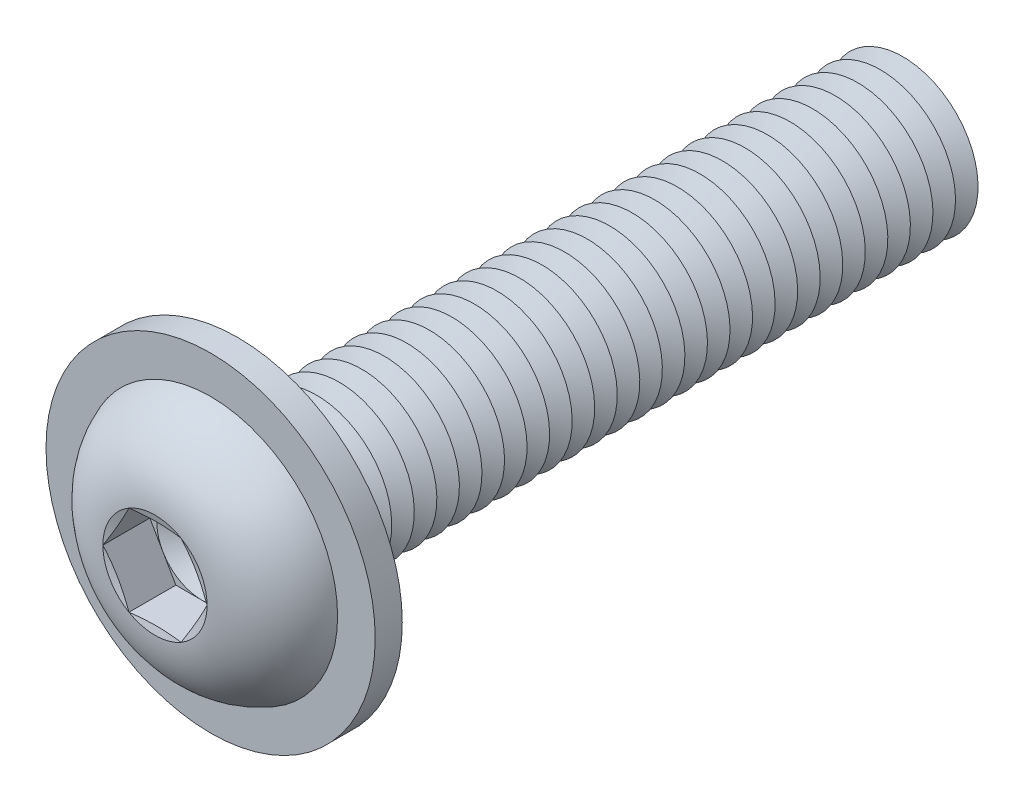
ISO-10303-21;
HEADER;
FILE_DESCRIPTION(('STEP AP214'),'2;1');
FILE_NAME('part.step','',(''),(''),'','','');
FILE_SCHEMA(('AUTOMOTIVE_DESIGN { 1 0 10303 214 1 1 1 1 }'));
ENDSEC;
DATA;
#1=APPLICATION_CONTEXT('core data for automotive mechanical design processes');
#2=APPLICATION_PROTOCOL_DEFINITION('international standard','automotive_design',2000,#1);
#3=PRODUCT_CONTEXT('',#1,'mechanical');
#4=PRODUCT('Part','Part','',(#3));
#5=PRODUCT_RELATED_PRODUCT_CATEGORY('part','',(#4));
#6=PRODUCT_DEFINITION_FORMATION('','',#4);
#7=PRODUCT_DEFINITION_CONTEXT('part definition',#1,'design');
#8=PRODUCT_DEFINITION('design','',#6,#7);
#9=PRODUCT_DEFINITION_SHAPE('','',#8);
#10=(LENGTH_UNIT() NAMED_UNIT(*) SI_UNIT(.MILLI.,.METRE.));
#11=(NAMED_UNIT(*) PLANE_ANGLE_UNIT() SI_UNIT($,.RADIAN.));
#12=(NAMED_UNIT(*) SI_UNIT($,.STERADIAN.) SOLID_ANGLE_UNIT());
#13=UNCERTAINTY_MEASURE_WITH_UNIT(LENGTH_MEASURE(1.E-05),#10,'distance_accuracy_value','');
#14=(GEOMETRIC_REPRESENTATION_CONTEXT(3) GLOBAL_UNCERTAINTY_ASSIGNED_CONTEXT((#13)) GLOBAL_UNIT_ASSIGNED_CONTEXT((#10,
#11,#12)) REPRESENTATION_CONTEXT('',''));
#15=CARTESIAN_POINT('',(0.,0.,0.));
#16=DIRECTION('',(0.,0.,1.));
#17=DIRECTION('',(1.,0.,0.));
#18=AXIS2_PLACEMENT_3D('',#15,#16,#17);
#19=CARTESIAN_POINT('',(0.,0.,-39.75));
#20=DIRECTION('',(0.,0.,1.));
#21=DIRECTION('',(0.,-1.,0.));
#22=AXIS2_PLACEMENT_3D('',#19,#20,#21);
#23=CONICAL_SURFACE('',#22,4.99999999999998,1.0471975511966);
#24=CARTESIAN_POINT('',(0.,0.,-40.5));
#25=DIRECTION('',(0.,0.,1.));
#26=DIRECTION('',(0.,-1.,0.));
#27=AXIS2_PLACEMENT_3D('',#24,#25,#26);
#28=CIRCLE('',#27,3.70096189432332);
#29=CARTESIAN_POINT('',(0.,-3.7009618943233,-40.5));
#30=VERTEX_POINT('',#29);
#31=EDGE_CURVE('E324',#30,#30,#28,.T.);
#32=ORIENTED_EDGE('',*,*,#31,.T.);
#33=EDGE_LOOP('',(#32));
#34=FACE_BOUND('',#33,.T.);
#35=CARTESIAN_POINT('',(0.,0.,-39.75));
#36=DIRECTION('',(0.,0.,1.));
#37=DIRECTION('',(0.,-1.,0.));
#38=AXIS2_PLACEMENT_3D('',#35,#36,#37);
#39=CIRCLE('',#38,4.99999999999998);
#40=CARTESIAN_POINT('',(0.,-4.99999999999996,-39.75));
#41=VERTEX_POINT('',#40);
#42=EDGE_CURVE('E443',#41,#41,#39,.T.);
#43=ORIENTED_EDGE('',*,*,#42,.F.);
#44=EDGE_LOOP('',(#43));
#45=FACE_BOUND('',#44,.T.);
#46=ADVANCED_FACE('F39',(#34,#45),#23,.T.);
#47=CARTESIAN_POINT('',(0.,0.,-40.5));
#48=DIRECTION('',(0.,0.,-1.));
#49=DIRECTION('',(0.,1.,0.));
#50=AXIS2_PLACEMENT_3D('',#47,#48,#49);
#51=CONICAL_SURFACE('',#50,3.70096189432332,1.0471975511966);
#52=CARTESIAN_POINT('',(0.,0.,-41.25));
#53=DIRECTION('',(0.,0.,1.));
#54=DIRECTION('',(0.,-1.,0.));
#55=AXIS2_PLACEMENT_3D('',#52,#53,#54);
#56=CIRCLE('',#55,4.99999999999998);
#57=CARTESIAN_POINT('',(0.,-4.99999999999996,-41.25));
#58=VERTEX_POINT('',#57);
#59=EDGE_CURVE('E449',#58,#58,#56,.T.);
#60=ORIENTED_EDGE('',*,*,#59,.T.);
#61=EDGE_LOOP('',(#60));
#62=FACE_BOUND('',#61,.T.);
#63=ORIENTED_EDGE('',*,*,#31,.F.);
#64=EDGE_LOOP('',(#63));
#65=FACE_BOUND('',#64,.T.);
#66=ADVANCED_FACE('F482',(#62,#65),#51,.T.);
#67=CARTESIAN_POINT('',(0.,4.99999999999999,-45.));
#68=DIRECTION('',(0.,0.,-1.));
#69=DIRECTION('',(0.,1.,0.));
#70=AXIS2_PLACEMENT_3D('',#67,#68,#69);
#71=PLANE('',#70);
#72=CARTESIAN_POINT('',(0.,0.,-45.));
#73=DIRECTION('',(0.,0.,1.));
#74=DIRECTION('',(0.,-1.,0.));
#75=AXIS2_PLACEMENT_3D('',#72,#73,#74);
#76=CIRCLE('',#75,3.70096189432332);
#77=CARTESIAN_POINT('',(0.,-3.7009618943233,-45.));
#78=VERTEX_POINT('',#77);
#79=EDGE_CURVE('E298',#78,#78,#76,.T.);
#80=ORIENTED_EDGE('',*,*,#79,.F.);
#81=EDGE_LOOP('',(#80));
#82=FACE_BOUND('',#81,.T.);
#83=ADVANCED_FACE('F473',(#82),#71,.T.);
#84=CARTESIAN_POINT('',(0.,0.,-44.25));
#85=DIRECTION('',(0.,0.,1.));
#86=DIRECTION('',(0.,-1.,0.));
#87=AXIS2_PLACEMENT_3D('',#84,#85,#86);
#88=CONICAL_SURFACE('',#87,4.99999999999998,1.0471975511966);
#89=ORIENTED_EDGE('',*,*,#79,.T.);
#90=EDGE_LOOP('',(#89));
#91=FACE_BOUND('',#90,.T.);
#92=CARTESIAN_POINT('',(0.,0.,-44.25));
#93=DIRECTION('',(0.,0.,1.));
#94=DIRECTION('',(0.,-1.,0.));
#95=AXIS2_PLACEMENT_3D('',#92,#93,#94);
#96=CIRCLE('',#95,4.99999999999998);
#97=CARTESIAN_POINT('',(0.,-4.99999999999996,-44.25));
#98=VERTEX_POINT('',#97);
#99=EDGE_CURVE('E347',#98,#98,#96,.T.);
#100=ORIENTED_EDGE('',*,*,#99,.F.);
#101=EDGE_LOOP('',(#100));
#102=FACE_BOUND('',#101,.T.);
#103=ADVANCED_FACE('F471',(#91,#102),#88,.T.);
#104=CARTESIAN_POINT('',(0.,0.,-43.5));
#105=DIRECTION('',(0.,0.,-1.));
#106=DIRECTION('',(0.,1.,0.));
#107=AXIS2_PLACEMENT_3D('',#104,#105,#106);
#108=CONICAL_SURFACE('',#107,3.70096189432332,1.0471975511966);
#109=ORIENTED_EDGE('',*,*,#99,.T.);
#110=EDGE_LOOP('',(#109));
#111=FACE_BOUND('',#110,.T.);
#112=CARTESIAN_POINT('',(0.,0.,-43.5));
#113=DIRECTION('',(0.,0.,1.));
#114=DIRECTION('',(0.,-1.,0.));
#115=AXIS2_PLACEMENT_3D('',#112,#113,#114);
#116=CIRCLE('',#115,3.70096189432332);
#117=CARTESIAN_POINT('',(0.,-3.7009618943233,-43.5));
#118=VERTEX_POINT('',#117);
#119=EDGE_CURVE('E461',#118,#118,#116,.T.);
#120=ORIENTED_EDGE('',*,*,#119,.F.);
#121=EDGE_LOOP('',(#120));
#122=FACE_BOUND('',#121,.T.);
#123=ADVANCED_FACE('F468',(#111,#122),#108,.T.);
#124=CARTESIAN_POINT('',(0.,0.,-42.75));
#125=DIRECTION('',(0.,0.,1.));
#126=DIRECTION('',(0.,-1.,0.));
#127=AXIS2_PLACEMENT_3D('',#124,#125,#126);
#128=CONICAL_SURFACE('',#127,4.99999999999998,1.0471975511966);
#129=ORIENTED_EDGE('',*,*,#119,.T.);
#130=EDGE_LOOP('',(#129));
#131=FACE_BOUND('',#130,.T.);
#132=CARTESIAN_POINT('',(0.,0.,-42.75));
#133=DIRECTION('',(0.,0.,1.));
#134=DIRECTION('',(0.,-1.,0.));
#135=AXIS2_PLACEMENT_3D('',#132,#133,#134);
#136=CIRCLE('',#135,4.99999999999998);
#137=CARTESIAN_POINT('',(0.,-4.99999999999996,-42.75));
#138=VERTEX_POINT('',#137);
#139=EDGE_CURVE('E457',#138,#138,#136,.T.);
#140=ORIENTED_EDGE('',*,*,#139,.F.);
#141=EDGE_LOOP('',(#140));
#142=FACE_BOUND('',#141,.T.);
#143=ADVANCED_FACE('F480',(#131,#142),#128,.T.);
#144=CARTESIAN_POINT('',(0.,0.,-42.));
#145=DIRECTION('',(0.,0.,-1.));
#146=DIRECTION('',(0.,1.,0.));
#147=AXIS2_PLACEMENT_3D('',#144,#145,#146);
#148=CONICAL_SURFACE('',#147,3.70096189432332,1.0471975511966);
#149=ORIENTED_EDGE('',*,*,#139,.T.);
#150=EDGE_LOOP('',(#149));
#151=FACE_BOUND('',#150,.T.);
#152=CARTESIAN_POINT('',(0.,0.,-42.));
#153=DIRECTION('',(0.,0.,1.));
#154=DIRECTION('',(0.,-1.,0.));
#155=AXIS2_PLACEMENT_3D('',#152,#153,#154);
#156=CIRCLE('',#155,3.70096189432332);
#157=CARTESIAN_POINT('',(0.,-3.7009618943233,-42.));
#158=VERTEX_POINT('',#157);
#159=EDGE_CURVE('E453',#158,#158,#156,.T.);
#160=ORIENTED_EDGE('',*,*,#159,.F.);
#161=EDGE_LOOP('',(#160));
#162=FACE_BOUND('',#161,.T.);
#163=ADVANCED_FACE('F496',(#151,#162),#148,.T.);
#164=CARTESIAN_POINT('',(0.,0.,-41.25));
#165=DIRECTION('',(0.,0.,1.));
#166=DIRECTION('',(0.,-1.,0.));
#167=AXIS2_PLACEMENT_3D('',#164,#165,#166);
#168=CONICAL_SURFACE('',#167,4.99999999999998,1.0471975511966);
#169=ORIENTED_EDGE('',*,*,#159,.T.);
#170=EDGE_LOOP('',(#169));
#171=FACE_BOUND('',#170,.T.);
#172=ORIENTED_EDGE('',*,*,#59,.F.);
#173=EDGE_LOOP('',(#172));
#174=FACE_BOUND('',#173,.T.);
#175=ADVANCED_FACE('F499',(#171,#174),#168,.T.);
#176=CARTESIAN_POINT('',(0.,0.,-38.25));
#177=DIRECTION('',(0.,0.,1.));
#178=DIRECTION('',(0.,-1.,0.));
#179=AXIS2_PLACEMENT_3D('',#176,#177,#178);
#180=CONICAL_SURFACE('',#179,4.99999999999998,1.0471975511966);
#181=CARTESIAN_POINT('',(0.,0.,-39.));
#182=DIRECTION('',(0.,0.,1.));
#183=DIRECTION('',(0.,-1.,0.));
#184=AXIS2_PLACEMENT_3D('',#181,#182,#183);
#185=CIRCLE('',#184,3.70096189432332);
#186=CARTESIAN_POINT('',(0.,-3.7009618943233,-39.));
#187=VERTEX_POINT('',#186);
#188=EDGE_CURVE('E440',#187,#187,#185,.T.);
#189=ORIENTED_EDGE('',*,*,#188,.T.);
#190=EDGE_LOOP('',(#189));
#191=FACE_BOUND('',#190,.T.);
#192=CARTESIAN_POINT('',(0.,0.,-38.25));
#193=DIRECTION('',(0.,0.,1.));
#194=DIRECTION('',(0.,-1.,0.));
#195=AXIS2_PLACEMENT_3D('',#192,#193,#194);
#196=CIRCLE('',#195,4.99999999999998);
#197=CARTESIAN_POINT('',(0.,-4.99999999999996,-38.25));
#198=VERTEX_POINT('',#197);
#199=EDGE_CURVE('E436',#198,#198,#196,.T.);
#200=ORIENTED_EDGE('',*,*,#199,.F.);
#201=EDGE_LOOP('',(#200));
#202=FACE_BOUND('',#201,.T.);
#203=ADVANCED_FACE('F502',(#191,#202),#180,.T.);
#204=CARTESIAN_POINT('',(0.,0.,-39.));
#205=DIRECTION('',(0.,0.,-1.));
#206=DIRECTION('',(0.,1.,0.));
#207=AXIS2_PLACEMENT_3D('',#204,#205,#206);
#208=CONICAL_SURFACE('',#207,3.70096189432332,1.0471975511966);
#209=ORIENTED_EDGE('',*,*,#42,.T.);
#210=EDGE_LOOP('',(#209));
#211=FACE_BOUND('',#210,.T.);
#212=ORIENTED_EDGE('',*,*,#188,.F.);
#213=EDGE_LOOP('',(#212));
#214=FACE_BOUND('',#213,.T.);
#215=ADVANCED_FACE('F530',(#211,#214),#208,.T.);
#216=CARTESIAN_POINT('',(0.,0.,-36.75));
#217=DIRECTION('',(0.,0.,1.));
#218=DIRECTION('',(0.,-1.,0.));
#219=AXIS2_PLACEMENT_3D('',#216,#217,#218);
#220=CONICAL_SURFACE('',#219,4.99999999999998,1.0471975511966);
#221=CARTESIAN_POINT('',(0.,0.,-37.5));
#222=DIRECTION('',(0.,0.,1.));
#223=DIRECTION('',(0.,-1.,0.));
#224=AXIS2_PLACEMENT_3D('',#221,#222,#223);
#225=CIRCLE('',#224,3.70096189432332);
#226=CARTESIAN_POINT('',(0.,-3.7009618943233,-37.5));
#227=VERTEX_POINT('',#226);
#228=EDGE_CURVE('E432',#227,#227,#225,.T.);
#229=ORIENTED_EDGE('',*,*,#228,.T.);
#230=EDGE_LOOP('',(#229));
#231=FACE_BOUND('',#230,.T.);
#232=CARTESIAN_POINT('',(0.,0.,-36.75));
#233=DIRECTION('',(0.,0.,1.));
#234=DIRECTION('',(0.,-1.,0.));
#235=AXIS2_PLACEMENT_3D('',#232,#233,#234);
#236=CIRCLE('',#235,4.99999999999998);
#237=CARTESIAN_POINT('',(0.,-4.99999999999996,-36.75));
#238=VERTEX_POINT('',#237);
#239=EDGE_CURVE('E428',#238,#238,#236,.T.);
#240=ORIENTED_EDGE('',*,*,#239,.F.);
#241=EDGE_LOOP('',(#240));
#242=FACE_BOUND('',#241,.T.);
#243=ADVANCED_FACE('F536',(#231,#242),#220,.T.);
#244=CARTESIAN_POINT('',(0.,0.,-37.5));
#245=DIRECTION('',(0.,0.,-1.));
#246=DIRECTION('',(0.,1.,0.));
#247=AXIS2_PLACEMENT_3D('',#244,#245,#246);
#248=CONICAL_SURFACE('',#247,3.70096189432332,1.0471975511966);
#249=ORIENTED_EDGE('',*,*,#199,.T.);
#250=EDGE_LOOP('',(#249));
#251=FACE_BOUND('',#250,.T.);
#252=ORIENTED_EDGE('',*,*,#228,.F.);
#253=EDGE_LOOP('',(#252));
#254=FACE_BOUND('',#253,.T.);
#255=ADVANCED_FACE('F543',(#251,#254),#248,.T.);
#256=CARTESIAN_POINT('',(0.,0.,-35.25));
#257=DIRECTION('',(0.,0.,1.));
#258=DIRECTION('',(0.,-1.,0.));
#259=AXIS2_PLACEMENT_3D('',#256,#257,#258);
#260=CONICAL_SURFACE('',#259,4.99999999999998,1.0471975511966);
#261=CARTESIAN_POINT('',(0.,0.,-36.));
#262=DIRECTION('',(0.,0.,1.));
#263=DIRECTION('',(0.,-1.,0.));
#264=AXIS2_PLACEMENT_3D('',#261,#262,#263);
#265=CIRCLE('',#264,3.70096189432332);
#266=CARTESIAN_POINT('',(0.,-3.7009618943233,-36.));
#267=VERTEX_POINT('',#266);
#268=EDGE_CURVE('E424',#267,#267,#265,.T.);
#269=ORIENTED_EDGE('',*,*,#268,.T.);
#270=EDGE_LOOP('',(#269));
#271=FACE_BOUND('',#270,.T.);
#272=CARTESIAN_POINT('',(0.,0.,-35.25));
#273=DIRECTION('',(0.,0.,1.));
#274=DIRECTION('',(0.,-1.,0.));
#275=AXIS2_PLACEMENT_3D('',#272,#273,#274);
#276=CIRCLE('',#275,4.99999999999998);
#277=CARTESIAN_POINT('',(0.,-4.99999999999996,-35.25));
#278=VERTEX_POINT('',#277);
#279=EDGE_CURVE('E420',#278,#278,#276,.T.);
#280=ORIENTED_EDGE('',*,*,#279,.F.);
#281=EDGE_LOOP('',(#280));
#282=FACE_BOUND('',#281,.T.);
#283=ADVANCED_FACE('F550',(#271,#282),#260,.T.);
#284=CARTESIAN_POINT('',(0.,0.,-36.));
#285=DIRECTION('',(0.,0.,-1.));
#286=DIRECTION('',(0.,1.,0.));
#287=AXIS2_PLACEMENT_3D('',#284,#285,#286);
#288=CONICAL_SURFACE('',#287,3.70096189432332,1.0471975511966);
#289=ORIENTED_EDGE('',*,*,#239,.T.);
#290=EDGE_LOOP('',(#289));
#291=FACE_BOUND('',#290,.T.);
#292=ORIENTED_EDGE('',*,*,#268,.F.);
#293=EDGE_LOOP('',(#292));
#294=FACE_BOUND('',#293,.T.);
#295=ADVANCED_FACE('F557',(#291,#294),#288,.T.);
#296=CARTESIAN_POINT('',(0.,0.,-33.75));
#297=DIRECTION('',(0.,0.,1.));
#298=DIRECTION('',(0.,-1.,0.));
#299=AXIS2_PLACEMENT_3D('',#296,#297,#298);
#300=CONICAL_SURFACE('',#299,4.99999999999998,1.0471975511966);
#301=CARTESIAN_POINT('',(0.,0.,-34.5));
#302=DIRECTION('',(0.,0.,1.));
#303=DIRECTION('',(0.,-1.,0.));
#304=AXIS2_PLACEMENT_3D('',#301,#302,#303);
#305=CIRCLE('',#304,3.70096189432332);
#306=CARTESIAN_POINT('',(0.,-3.7009618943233,-34.5));
#307=VERTEX_POINT('',#306);
#308=EDGE_CURVE('E416',#307,#307,#305,.T.);
#309=ORIENTED_EDGE('',*,*,#308,.T.);
#310=EDGE_LOOP('',(#309));
#311=FACE_BOUND('',#310,.T.);
#312=CARTESIAN_POINT('',(0.,0.,-33.75));
#313=DIRECTION('',(0.,0.,1.));
#314=DIRECTION('',(0.,-1.,0.));
#315=AXIS2_PLACEMENT_3D('',#312,#313,#314);
#316=CIRCLE('',#315,4.99999999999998);
#317=CARTESIAN_POINT('',(0.,-4.99999999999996,-33.75));
#318=VERTEX_POINT('',#317);
#319=EDGE_CURVE('E412',#318,#318,#316,.T.);
#320=ORIENTED_EDGE('',*,*,#319,.F.);
#321=EDGE_LOOP('',(#320));
#322=FACE_BOUND('',#321,.T.);
#323=ADVANCED_FACE('F564',(#311,#322),#300,.T.);
#324=CARTESIAN_POINT('',(0.,0.,-34.5));
#325=DIRECTION('',(0.,0.,-1.));
#326=DIRECTION('',(0.,1.,0.));
#327=AXIS2_PLACEMENT_3D('',#324,#325,#326);
#328=CONICAL_SURFACE('',#327,3.70096189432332,1.0471975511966);
#329=ORIENTED_EDGE('',*,*,#279,.T.);
#330=EDGE_LOOP('',(#329));
#331=FACE_BOUND('',#330,.T.);
#332=ORIENTED_EDGE('',*,*,#308,.F.);
#333=EDGE_LOOP('',(#332));
#334=FACE_BOUND('',#333,.T.);
#335=ADVANCED_FACE('F571',(#331,#334),#328,.T.);
#336=CARTESIAN_POINT('',(0.,0.,-32.25));
#337=DIRECTION('',(0.,0.,1.));
#338=DIRECTION('',(0.,-1.,0.));
#339=AXIS2_PLACEMENT_3D('',#336,#337,#338);
#340=CONICAL_SURFACE('',#339,4.99999999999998,1.0471975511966);
#341=CARTESIAN_POINT('',(0.,0.,-33.));
#342=DIRECTION('',(0.,0.,1.));
#343=DIRECTION('',(0.,-1.,0.));
#344=AXIS2_PLACEMENT_3D('',#341,#342,#343);
#345=CIRCLE('',#344,3.70096189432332);
#346=CARTESIAN_POINT('',(0.,-3.7009618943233,-33.));
#347=VERTEX_POINT('',#346);
#348=EDGE_CURVE('E408',#347,#347,#345,.T.);
#349=ORIENTED_EDGE('',*,*,#348,.T.);
#350=EDGE_LOOP('',(#349));
#351=FACE_BOUND('',#350,.T.);
#352=CARTESIAN_POINT('',(0.,0.,-32.25));
#353=DIRECTION('',(0.,0.,1.));
#354=DIRECTION('',(0.,-1.,0.));
#355=AXIS2_PLACEMENT_3D('',#352,#353,#354);
#356=CIRCLE('',#355,4.99999999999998);
#357=CARTESIAN_POINT('',(0.,-4.99999999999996,-32.25));
#358=VERTEX_POINT('',#357);
#359=EDGE_CURVE('E404',#358,#358,#356,.T.);
#360=ORIENTED_EDGE('',*,*,#359,.F.);
#361=EDGE_LOOP('',(#360));
#362=FACE_BOUND('',#361,.T.);
#363=ADVANCED_FACE('F578',(#351,#362),#340,.T.);
#364=CARTESIAN_POINT('',(0.,0.,-33.));
#365=DIRECTION('',(0.,0.,-1.));
#366=DIRECTION('',(0.,1.,0.));
#367=AXIS2_PLACEMENT_3D('',#364,#365,#366);
#368=CONICAL_SURFACE('',#367,3.70096189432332,1.0471975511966);
#369=ORIENTED_EDGE('',*,*,#319,.T.);
#370=EDGE_LOOP('',(#369));
#371=FACE_BOUND('',#370,.T.);
#372=ORIENTED_EDGE('',*,*,#348,.F.);
#373=EDGE_LOOP('',(#372));
#374=FACE_BOUND('',#373,.T.);
#375=ADVANCED_FACE('F585',(#371,#374),#368,.T.);
#376=CARTESIAN_POINT('',(0.,0.,-30.75));
#377=DIRECTION('',(0.,0.,1.));
#378=DIRECTION('',(0.,-1.,0.));
#379=AXIS2_PLACEMENT_3D('',#376,#377,#378);
#380=CONICAL_SURFACE('',#379,4.99999999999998,1.0471975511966);
#381=CARTESIAN_POINT('',(0.,0.,-31.5));
#382=DIRECTION('',(0.,0.,1.));
#383=DIRECTION('',(0.,-1.,0.));
#384=AXIS2_PLACEMENT_3D('',#381,#382,#383);
#385=CIRCLE('',#384,3.70096189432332);
#386=CARTESIAN_POINT('',(0.,-3.70096189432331,-31.5));
#387=VERTEX_POINT('',#386);
#388=EDGE_CURVE('E400',#387,#387,#385,.T.);
#389=ORIENTED_EDGE('',*,*,#388,.T.);
#390=EDGE_LOOP('',(#389));
#391=FACE_BOUND('',#390,.T.);
#392=CARTESIAN_POINT('',(0.,0.,-30.75));
#393=DIRECTION('',(0.,0.,1.));
#394=DIRECTION('',(0.,-1.,0.));
#395=AXIS2_PLACEMENT_3D('',#392,#393,#394);
#396=CIRCLE('',#395,4.99999999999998);
#397=CARTESIAN_POINT('',(0.,-4.99999999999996,-30.75));
#398=VERTEX_POINT('',#397);
#399=EDGE_CURVE('E397',#398,#398,#396,.T.);
#400=ORIENTED_EDGE('',*,*,#399,.F.);
#401=EDGE_LOOP('',(#400));
#402=FACE_BOUND('',#401,.T.);
#403=ADVANCED_FACE('F592',(#391,#402),#380,.T.);
#404=CARTESIAN_POINT('',(0.,0.,-31.5));
#405=DIRECTION('',(0.,0.,-1.));
#406=DIRECTION('',(0.,1.,0.));
#407=AXIS2_PLACEMENT_3D('',#404,#405,#406);
#408=CONICAL_SURFACE('',#407,3.70096189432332,1.0471975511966);
#409=ORIENTED_EDGE('',*,*,#359,.T.);
#410=EDGE_LOOP('',(#409));
#411=FACE_BOUND('',#410,.T.);
#412=ORIENTED_EDGE('',*,*,#388,.F.);
#413=EDGE_LOOP('',(#412));
#414=FACE_BOUND('',#413,.T.);
#415=ADVANCED_FACE('F599',(#411,#414),#408,.T.);
#416=CARTESIAN_POINT('',(0.,0.,-29.25));
#417=DIRECTION('',(0.,0.,1.));
#418=DIRECTION('',(0.,-1.,0.));
#419=AXIS2_PLACEMENT_3D('',#416,#417,#418);
#420=CONICAL_SURFACE('',#419,4.99999999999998,1.0471975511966);
#421=CARTESIAN_POINT('',(0.,0.,-30.));
#422=DIRECTION('',(0.,0.,1.));
#423=DIRECTION('',(0.,-1.,0.));
#424=AXIS2_PLACEMENT_3D('',#421,#422,#423);
#425=CIRCLE('',#424,3.70096189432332);
#426=CARTESIAN_POINT('',(0.,-3.70096189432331,-30.));
#427=VERTEX_POINT('',#426);
#428=EDGE_CURVE('E393',#427,#427,#425,.T.);
#429=ORIENTED_EDGE('',*,*,#428,.T.);
#430=EDGE_LOOP('',(#429));
#431=FACE_BOUND('',#430,.T.);
#432=CARTESIAN_POINT('',(0.,0.,-29.25));
#433=DIRECTION('',(0.,0.,1.));
#434=DIRECTION('',(0.,-1.,0.));
#435=AXIS2_PLACEMENT_3D('',#432,#433,#434);
#436=CIRCLE('',#435,4.99999999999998);
#437=CARTESIAN_POINT('',(0.,-4.99999999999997,-29.25));
#438=VERTEX_POINT('',#437);
#439=EDGE_CURVE('E389',#438,#438,#436,.T.);
#440=ORIENTED_EDGE('',*,*,#439,.F.);
#441=EDGE_LOOP('',(#440));
#442=FACE_BOUND('',#441,.T.);
#443=ADVANCED_FACE('F606',(#431,#442),#420,.T.);
#444=CARTESIAN_POINT('',(0.,0.,-30.));
#445=DIRECTION('',(0.,0.,-1.));
#446=DIRECTION('',(0.,1.,0.));
#447=AXIS2_PLACEMENT_3D('',#444,#445,#446);
#448=CONICAL_SURFACE('',#447,3.70096189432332,1.0471975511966);
#449=ORIENTED_EDGE('',*,*,#399,.T.);
#450=EDGE_LOOP('',(#449));
#451=FACE_BOUND('',#450,.T.);
#452=ORIENTED_EDGE('',*,*,#428,.F.);
#453=EDGE_LOOP('',(#452));
#454=FACE_BOUND('',#453,.T.);
#455=ADVANCED_FACE('F613',(#451,#454),#448,.T.);
#456=CARTESIAN_POINT('',(0.,0.,-27.75));
#457=DIRECTION('',(0.,0.,1.));
#458=DIRECTION('',(0.,-1.,0.));
#459=AXIS2_PLACEMENT_3D('',#456,#457,#458);
#460=CONICAL_SURFACE('',#459,4.99999999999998,1.0471975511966);
#461=CARTESIAN_POINT('',(0.,0.,-28.5));
#462=DIRECTION('',(0.,0.,1.));
#463=DIRECTION('',(0.,-1.,0.));
#464=AXIS2_PLACEMENT_3D('',#461,#462,#463);
#465=CIRCLE('',#464,3.70096189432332);
#466=CARTESIAN_POINT('',(0.,-3.70096189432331,-28.5));
#467=VERTEX_POINT('',#466);
#468=EDGE_CURVE('E386',#467,#467,#465,.T.);
#469=ORIENTED_EDGE('',*,*,#468,.T.);
#470=EDGE_LOOP('',(#469));
#471=FACE_BOUND('',#470,.T.);
#472=CARTESIAN_POINT('',(0.,0.,-27.75));
#473=DIRECTION('',(0.,0.,1.));
#474=DIRECTION('',(0.,-1.,0.));
#475=AXIS2_PLACEMENT_3D('',#472,#473,#474);
#476=CIRCLE('',#475,4.99999999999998);
#477=CARTESIAN_POINT('',(0.,-4.99999999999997,-27.75));
#478=VERTEX_POINT('',#477);
#479=EDGE_CURVE('E382',#478,#478,#476,.T.);
#480=ORIENTED_EDGE('',*,*,#479,.F.);
#481=EDGE_LOOP('',(#480));
#482=FACE_BOUND('',#481,.T.);
#483=ADVANCED_FACE('F620',(#471,#482),#460,.T.);
#484=CARTESIAN_POINT('',(0.,0.,-28.5));
#485=DIRECTION('',(0.,0.,-1.));
#486=DIRECTION('',(0.,1.,0.));
#487=AXIS2_PLACEMENT_3D('',#484,#485,#486);
#488=CONICAL_SURFACE('',#487,3.70096189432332,1.0471975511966);
#489=ORIENTED_EDGE('',*,*,#439,.T.);
#490=EDGE_LOOP('',(#489));
#491=FACE_BOUND('',#490,.T.);
#492=ORIENTED_EDGE('',*,*,#468,.F.);
#493=EDGE_LOOP('',(#492));
#494=FACE_BOUND('',#493,.T.);
#495=ADVANCED_FACE('F627',(#491,#494),#488,.T.);
#496=CARTESIAN_POINT('',(0.,0.,-26.25));
#497=DIRECTION('',(0.,0.,1.));
#498=DIRECTION('',(0.,-1.,0.));
#499=AXIS2_PLACEMENT_3D('',#496,#497,#498);
#500=CONICAL_SURFACE('',#499,4.99999999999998,1.0471975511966);
#501=CARTESIAN_POINT('',(0.,0.,-27.));
#502=DIRECTION('',(0.,0.,1.));
#503=DIRECTION('',(0.,-1.,0.));
#504=AXIS2_PLACEMENT_3D('',#501,#502,#503);
#505=CIRCLE('',#504,3.70096189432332);
#506=CARTESIAN_POINT('',(0.,-3.70096189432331,-27.));
#507=VERTEX_POINT('',#506);
#508=EDGE_CURVE('E378',#507,#507,#505,.T.);
#509=ORIENTED_EDGE('',*,*,#508,.T.);
#510=EDGE_LOOP('',(#509));
#511=FACE_BOUND('',#510,.T.);
#512=CARTESIAN_POINT('',(0.,0.,-26.25));
#513=DIRECTION('',(0.,0.,1.));
#514=DIRECTION('',(0.,-1.,0.));
#515=AXIS2_PLACEMENT_3D('',#512,#513,#514);
#516=CIRCLE('',#515,4.99999999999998);
#517=CARTESIAN_POINT('',(0.,-4.99999999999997,-26.25));
#518=VERTEX_POINT('',#517);
#519=EDGE_CURVE('E342',#518,#518,#516,.T.);
#520=ORIENTED_EDGE('',*,*,#519,.F.);
#521=EDGE_LOOP('',(#520));
#522=FACE_BOUND('',#521,.T.);
#523=ADVANCED_FACE('F634',(#511,#522),#500,.T.);
#524=CARTESIAN_POINT('',(0.,0.,-27.));
#525=DIRECTION('',(0.,0.,-1.));
#526=DIRECTION('',(0.,1.,0.));
#527=AXIS2_PLACEMENT_3D('',#524,#525,#526);
#528=CONICAL_SURFACE('',#527,3.70096189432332,1.0471975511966);
#529=ORIENTED_EDGE('',*,*,#479,.T.);
#530=EDGE_LOOP('',(#529));
#531=FACE_BOUND('',#530,.T.);
#532=ORIENTED_EDGE('',*,*,#508,.F.);
#533=EDGE_LOOP('',(#532));
#534=FACE_BOUND('',#533,.T.);
#535=ADVANCED_FACE('F641',(#531,#534),#528,.T.);
#536=CARTESIAN_POINT('',(0.,0.,-24.75));
#537=DIRECTION('',(0.,0.,1.));
#538=DIRECTION('',(0.,-1.,0.));
#539=AXIS2_PLACEMENT_3D('',#536,#537,#538);
#540=CONICAL_SURFACE('',#539,4.99999999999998,1.0471975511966);
#541=CARTESIAN_POINT('',(0.,0.,-25.5));
#542=DIRECTION('',(0.,0.,1.));
#543=DIRECTION('',(0.,-1.,0.));
#544=AXIS2_PLACEMENT_3D('',#541,#542,#543);
#545=CIRCLE('',#544,3.70096189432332);
#546=CARTESIAN_POINT('',(0.,-3.70096189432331,-25.5));
#547=VERTEX_POINT('',#546);
#548=EDGE_CURVE('E339',#547,#547,#545,.T.);
#549=ORIENTED_EDGE('',*,*,#548,.T.);
#550=EDGE_LOOP('',(#549));
#551=FACE_BOUND('',#550,.T.);
#552=CARTESIAN_POINT('',(0.,0.,-24.75));
#553=DIRECTION('',(0.,0.,1.));
#554=DIRECTION('',(0.,-1.,0.));
#555=AXIS2_PLACEMENT_3D('',#552,#553,#554);
#556=CIRCLE('',#555,4.99999999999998);
#557=CARTESIAN_POINT('',(0.,-4.99999999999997,-24.75));
#558=VERTEX_POINT('',#557);
#559=EDGE_CURVE('E343',#558,#558,#556,.T.);
#560=ORIENTED_EDGE('',*,*,#559,.F.);
#561=EDGE_LOOP('',(#560));
#562=FACE_BOUND('',#561,.T.);
#563=ADVANCED_FACE('F648',(#551,#562),#540,.T.);
#564=CARTESIAN_POINT('',(0.,0.,-25.5));
#565=DIRECTION('',(0.,0.,-1.));
#566=DIRECTION('',(0.,1.,0.));
#567=AXIS2_PLACEMENT_3D('',#564,#565,#566);
#568=CONICAL_SURFACE('',#567,3.70096189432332,1.0471975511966);
#569=ORIENTED_EDGE('',*,*,#519,.T.);
#570=EDGE_LOOP('',(#569));
#571=FACE_BOUND('',#570,.T.);
#572=ORIENTED_EDGE('',*,*,#548,.F.);
#573=EDGE_LOOP('',(#572));
#574=FACE_BOUND('',#573,.T.);
#575=ADVANCED_FACE('F655',(#571,#574),#568,.T.);
#576=CARTESIAN_POINT('',(0.,0.,-23.25));
#577=DIRECTION('',(0.,0.,1.));
#578=DIRECTION('',(0.,-1.,0.));
#579=AXIS2_PLACEMENT_3D('',#576,#577,#578);
#580=CONICAL_SURFACE('',#579,4.99999999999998,1.0471975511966);
#581=CARTESIAN_POINT('',(0.,0.,-24.));
#582=DIRECTION('',(0.,0.,1.));
#583=DIRECTION('',(0.,-1.,0.));
#584=AXIS2_PLACEMENT_3D('',#581,#582,#583);
#585=CIRCLE('',#584,3.70096189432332);
#586=CARTESIAN_POINT('',(0.,-3.70096189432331,-24.));
#587=VERTEX_POINT('',#586);
#588=EDGE_CURVE('E360',#587,#587,#585,.T.);
#589=ORIENTED_EDGE('',*,*,#588,.T.);
#590=EDGE_LOOP('',(#589));
#591=FACE_BOUND('',#590,.T.);
#592=CARTESIAN_POINT('',(0.,0.,-23.25));
#593=DIRECTION('',(0.,0.,1.));
#594=DIRECTION('',(0.,-1.,0.));
#595=AXIS2_PLACEMENT_3D('',#592,#593,#594);
#596=CIRCLE('',#595,4.99999999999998);
#597=CARTESIAN_POINT('',(0.,-4.99999999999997,-23.25));
#598=VERTEX_POINT('',#597);
#599=EDGE_CURVE('E362',#598,#598,#596,.T.);
#600=ORIENTED_EDGE('',*,*,#599,.F.);
#601=EDGE_LOOP('',(#600));
#602=FACE_BOUND('',#601,.T.);
#603=ADVANCED_FACE('F662',(#591,#602),#580,.T.);
#604=CARTESIAN_POINT('',(0.,0.,-24.));
#605=DIRECTION('',(0.,0.,-1.));
#606=DIRECTION('',(0.,1.,0.));
#607=AXIS2_PLACEMENT_3D('',#604,#605,#606);
#608=CONICAL_SURFACE('',#607,3.70096189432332,1.0471975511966);
#609=ORIENTED_EDGE('',*,*,#559,.T.);
#610=EDGE_LOOP('',(#609));
#611=FACE_BOUND('',#610,.T.);
#612=ORIENTED_EDGE('',*,*,#588,.F.);
#613=EDGE_LOOP('',(#612));
#614=FACE_BOUND('',#613,.T.);
#615=ADVANCED_FACE('F669',(#611,#614),#608,.T.);
#616=CARTESIAN_POINT('',(0.,0.,-21.75));
#617=DIRECTION('',(0.,0.,1.));
#618=DIRECTION('',(0.,-1.,0.));
#619=AXIS2_PLACEMENT_3D('',#616,#617,#618);
#620=CONICAL_SURFACE('',#619,4.99999999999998,1.0471975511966);
#621=CARTESIAN_POINT('',(0.,0.,-22.5));
#622=DIRECTION('',(0.,0.,1.));
#623=DIRECTION('',(0.,-1.,0.));
#624=AXIS2_PLACEMENT_3D('',#621,#622,#623);
#625=CIRCLE('',#624,3.70096189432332);
#626=CARTESIAN_POINT('',(0.,-3.70096189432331,-22.5));
#627=VERTEX_POINT('',#626);
#628=EDGE_CURVE('E371',#627,#627,#625,.T.);
#629=ORIENTED_EDGE('',*,*,#628,.T.);
#630=EDGE_LOOP('',(#629));
#631=FACE_BOUND('',#630,.T.);
#632=CARTESIAN_POINT('',(0.,0.,-21.75));
#633=DIRECTION('',(0.,0.,1.));
#634=DIRECTION('',(0.,-1.,0.));
#635=AXIS2_PLACEMENT_3D('',#632,#633,#634);
#636=CIRCLE('',#635,4.99999999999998);
#637=CARTESIAN_POINT('',(0.,-4.99999999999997,-21.75));
#638=VERTEX_POINT('',#637);
#639=EDGE_CURVE('E336',#638,#638,#636,.T.);
#640=ORIENTED_EDGE('',*,*,#639,.F.);
#641=EDGE_LOOP('',(#640));
#642=FACE_BOUND('',#641,.T.);
#643=ADVANCED_FACE('F675',(#631,#642),#620,.T.);
#644=CARTESIAN_POINT('',(0.,0.,-22.5));
#645=DIRECTION('',(0.,0.,-1.));
#646=DIRECTION('',(0.,1.,0.));
#647=AXIS2_PLACEMENT_3D('',#644,#645,#646);
#648=CONICAL_SURFACE('',#647,3.70096189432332,1.0471975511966);
#649=ORIENTED_EDGE('',*,*,#599,.T.);
#650=EDGE_LOOP('',(#649));
#651=FACE_BOUND('',#650,.T.);
#652=ORIENTED_EDGE('',*,*,#628,.F.);
#653=EDGE_LOOP('',(#652));
#654=FACE_BOUND('',#653,.T.);
#655=ADVANCED_FACE('F682',(#651,#654),#648,.T.);
#656=CARTESIAN_POINT('',(0.,0.,-20.25));
#657=DIRECTION('',(0.,0.,1.));
#658=DIRECTION('',(0.,-1.,0.));
#659=AXIS2_PLACEMENT_3D('',#656,#657,#658);
#660=CONICAL_SURFACE('',#659,4.99999999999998,1.0471975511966);
#661=CARTESIAN_POINT('',(0.,0.,-21.));
#662=DIRECTION('',(0.,0.,1.));
#663=DIRECTION('',(0.,-1.,0.));
#664=AXIS2_PLACEMENT_3D('',#661,#662,#663);
#665=CIRCLE('',#664,3.70096189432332);
#666=CARTESIAN_POINT('',(0.,-3.70096189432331,-21.));
#667=VERTEX_POINT('',#666);
#668=EDGE_CURVE('E333',#667,#667,#665,.T.);
#669=ORIENTED_EDGE('',*,*,#668,.T.);
#670=EDGE_LOOP('',(#669));
#671=FACE_BOUND('',#670,.T.);
#672=CARTESIAN_POINT('',(0.,0.,-20.25));
#673=DIRECTION('',(0.,0.,1.));
#674=DIRECTION('',(0.,-1.,0.));
#675=AXIS2_PLACEMENT_3D('',#672,#673,#674);
#676=CIRCLE('',#675,4.99999999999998);
#677=CARTESIAN_POINT('',(0.,-4.99999999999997,-20.25));
#678=VERTEX_POINT('',#677);
#679=EDGE_CURVE('E337',#678,#678,#676,.T.);
#680=ORIENTED_EDGE('',*,*,#679,.F.);
#681=EDGE_LOOP('',(#680));
#682=FACE_BOUND('',#681,.T.);
#683=ADVANCED_FACE('F689',(#671,#682),#660,.T.);
#684=CARTESIAN_POINT('',(0.,0.,-21.));
#685=DIRECTION('',(0.,0.,-1.));
#686=DIRECTION('',(0.,1.,0.));
#687=AXIS2_PLACEMENT_3D('',#684,#685,#686);
#688=CONICAL_SURFACE('',#687,3.70096189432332,1.0471975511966);
#689=ORIENTED_EDGE('',*,*,#639,.T.);
#690=EDGE_LOOP('',(#689));
#691=FACE_BOUND('',#690,.T.);
#692=ORIENTED_EDGE('',*,*,#668,.F.);
#693=EDGE_LOOP('',(#692));
#694=FACE_BOUND('',#693,.T.);
#695=ADVANCED_FACE('F696',(#691,#694),#688,.T.);
#696=CARTESIAN_POINT('',(0.,0.,-18.75));
#697=DIRECTION('',(0.,0.,1.));
#698=DIRECTION('',(0.,-1.,0.));
#699=AXIS2_PLACEMENT_3D('',#696,#697,#698);
#700=CONICAL_SURFACE('',#699,4.99999999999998,1.0471975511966);
#701=CARTESIAN_POINT('',(0.,0.,-19.5));
#702=DIRECTION('',(0.,0.,1.));
#703=DIRECTION('',(0.,-1.,0.));
#704=AXIS2_PLACEMENT_3D('',#701,#702,#703);
#705=CIRCLE('',#704,3.70096189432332);
#706=CARTESIAN_POINT('',(0.,-3.70096189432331,-19.5));
#707=VERTEX_POINT('',#706);
#708=EDGE_CURVE('E1438',#707,#707,#705,.T.);
#709=ORIENTED_EDGE('',*,*,#708,.T.);
#710=EDGE_LOOP('',(#709));
#711=FACE_BOUND('',#710,.T.);
#712=CARTESIAN_POINT('',(0.,0.,-18.75));
#713=DIRECTION('',(0.,0.,1.));
#714=DIRECTION('',(0.,-1.,0.));
#715=AXIS2_PLACEMENT_3D('',#712,#713,#714);
#716=CIRCLE('',#715,4.99999999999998);
#717=CARTESIAN_POINT('',(0.,-4.99999999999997,-18.75));
#718=VERTEX_POINT('',#717);
#719=EDGE_CURVE('E1407',#718,#718,#716,.T.);
#720=ORIENTED_EDGE('',*,*,#719,.F.);
#721=EDGE_LOOP('',(#720));
#722=FACE_BOUND('',#721,.T.);
#723=ADVANCED_FACE('F703',(#711,#722),#700,.T.);
#724=CARTESIAN_POINT('',(0.,0.,-19.5));
#725=DIRECTION('',(0.,0.,-1.));
#726=DIRECTION('',(0.,1.,0.));
#727=AXIS2_PLACEMENT_3D('',#724,#725,#726);
#728=CONICAL_SURFACE('',#727,3.70096189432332,1.0471975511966);
#729=ORIENTED_EDGE('',*,*,#679,.T.);
#730=EDGE_LOOP('',(#729));
#731=FACE_BOUND('',#730,.T.);
#732=ORIENTED_EDGE('',*,*,#708,.F.);
#733=EDGE_LOOP('',(#732));
#734=FACE_BOUND('',#733,.T.);
#735=ADVANCED_FACE('F710',(#731,#734),#728,.T.);
#736=CARTESIAN_POINT('',(0.,0.,-17.25));
#737=DIRECTION('',(0.,0.,1.));
#738=DIRECTION('',(0.,-1.,0.));
#739=AXIS2_PLACEMENT_3D('',#736,#737,#738);
#740=CONICAL_SURFACE('',#739,4.99999999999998,1.0471975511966);
#741=CARTESIAN_POINT('',(0.,0.,-18.));
#742=DIRECTION('',(0.,0.,1.));
#743=DIRECTION('',(0.,-1.,0.));
#744=AXIS2_PLACEMENT_3D('',#741,#742,#743);
#745=CIRCLE('',#744,3.70096189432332);
#746=CARTESIAN_POINT('',(0.,-3.70096189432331,-18.));
#747=VERTEX_POINT('',#746);
#748=EDGE_CURVE('E358',#747,#747,#745,.T.);
#749=ORIENTED_EDGE('',*,*,#748,.T.);
#750=EDGE_LOOP('',(#749));
#751=FACE_BOUND('',#750,.T.);
#752=CARTESIAN_POINT('',(0.,0.,-17.25));
#753=DIRECTION('',(0.,0.,1.));
#754=DIRECTION('',(0.,-1.,0.));
#755=AXIS2_PLACEMENT_3D('',#752,#753,#754);
#756=CIRCLE('',#755,4.99999999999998);
#757=CARTESIAN_POINT('',(0.,-4.99999999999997,-17.25));
#758=VERTEX_POINT('',#757);
#759=EDGE_CURVE('E355',#758,#758,#756,.T.);
#760=ORIENTED_EDGE('',*,*,#759,.F.);
#761=EDGE_LOOP('',(#760));
#762=FACE_BOUND('',#761,.T.);
#763=ADVANCED_FACE('F717',(#751,#762),#740,.T.);
#764=CARTESIAN_POINT('',(0.,0.,-18.));
#765=DIRECTION('',(0.,0.,-1.));
#766=DIRECTION('',(0.,1.,0.));
#767=AXIS2_PLACEMENT_3D('',#764,#765,#766);
#768=CONICAL_SURFACE('',#767,3.70096189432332,1.0471975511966);
#769=ORIENTED_EDGE('',*,*,#719,.T.);
#770=EDGE_LOOP('',(#769));
#771=FACE_BOUND('',#770,.T.);
#772=ORIENTED_EDGE('',*,*,#748,.F.);
#773=EDGE_LOOP('',(#772));
#774=FACE_BOUND('',#773,.T.);
#775=ADVANCED_FACE('F724',(#771,#774),#768,.T.);
#776=CARTESIAN_POINT('',(0.,0.,-15.75));
#777=DIRECTION('',(0.,0.,1.));
#778=DIRECTION('',(0.,-1.,0.));
#779=AXIS2_PLACEMENT_3D('',#776,#777,#778);
#780=CONICAL_SURFACE('',#779,4.99999999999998,1.0471975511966);
#781=CARTESIAN_POINT('',(0.,0.,-16.5));
#782=DIRECTION('',(0.,0.,1.));
#783=DIRECTION('',(0.,-1.,0.));
#784=AXIS2_PLACEMENT_3D('',#781,#782,#783);
#785=CIRCLE('',#784,3.70096189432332);
#786=CARTESIAN_POINT('',(0.,-3.70096189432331,-16.5));
#787=VERTEX_POINT('',#786);
#788=EDGE_CURVE('E330',#787,#787,#785,.T.);
#789=ORIENTED_EDGE('',*,*,#788,.T.);
#790=EDGE_LOOP('',(#789));
#791=FACE_BOUND('',#790,.T.);
#792=CARTESIAN_POINT('',(0.,0.,-15.75));
#793=DIRECTION('',(0.,0.,1.));
#794=DIRECTION('',(0.,-1.,0.));
#795=AXIS2_PLACEMENT_3D('',#792,#793,#794);
#796=CIRCLE('',#795,4.99999999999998);
#797=CARTESIAN_POINT('',(0.,-4.99999999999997,-15.75));
#798=VERTEX_POINT('',#797);
#799=EDGE_CURVE('E327',#798,#798,#796,.T.);
#800=ORIENTED_EDGE('',*,*,#799,.F.);
#801=EDGE_LOOP('',(#800));
#802=FACE_BOUND('',#801,.T.);
#803=ADVANCED_FACE('F731',(#791,#802),#780,.T.);
#804=CARTESIAN_POINT('',(0.,0.,-16.5));
#805=DIRECTION('',(0.,0.,-1.));
#806=DIRECTION('',(0.,1.,0.));
#807=AXIS2_PLACEMENT_3D('',#804,#805,#806);
#808=CONICAL_SURFACE('',#807,3.70096189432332,1.0471975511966);
#809=ORIENTED_EDGE('',*,*,#759,.T.);
#810=EDGE_LOOP('',(#809));
#811=FACE_BOUND('',#810,.T.);
#812=ORIENTED_EDGE('',*,*,#788,.F.);
#813=EDGE_LOOP('',(#812));
#814=FACE_BOUND('',#813,.T.);
#815=ADVANCED_FACE('F738',(#811,#814),#808,.T.);
#816=CARTESIAN_POINT('',(0.,0.,-14.25));
#817=DIRECTION('',(0.,0.,1.));
#818=DIRECTION('',(0.,-1.,0.));
#819=AXIS2_PLACEMENT_3D('',#816,#817,#818);
#820=CONICAL_SURFACE('',#819,4.99999999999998,1.0471975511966);
#821=CARTESIAN_POINT('',(0.,0.,-15.));
#822=DIRECTION('',(0.,0.,1.));
#823=DIRECTION('',(0.,-1.,0.));
#824=AXIS2_PLACEMENT_3D('',#821,#822,#823);
#825=CIRCLE('',#824,3.70096189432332);
#826=CARTESIAN_POINT('',(0.,-3.70096189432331,-15.));
#827=VERTEX_POINT('',#826);
#828=EDGE_CURVE('E331',#827,#827,#825,.T.);
#829=ORIENTED_EDGE('',*,*,#828,.T.);
#830=EDGE_LOOP('',(#829));
#831=FACE_BOUND('',#830,.T.);
#832=CARTESIAN_POINT('',(0.,0.,-14.25));
#833=DIRECTION('',(0.,0.,1.));
#834=DIRECTION('',(0.,-1.,0.));
#835=AXIS2_PLACEMENT_3D('',#832,#833,#834);
#836=CIRCLE('',#835,4.99999999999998);
#837=CARTESIAN_POINT('',(0.,-4.99999999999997,-14.25));
#838=VERTEX_POINT('',#837);
#839=EDGE_CURVE('E1376',#838,#838,#836,.T.);
#840=ORIENTED_EDGE('',*,*,#839,.F.);
#841=EDGE_LOOP('',(#840));
#842=FACE_BOUND('',#841,.T.);
#843=ADVANCED_FACE('F745',(#831,#842),#820,.T.);
#844=CARTESIAN_POINT('',(0.,0.,-15.));
#845=DIRECTION('',(0.,0.,-1.));
#846=DIRECTION('',(0.,1.,0.));
#847=AXIS2_PLACEMENT_3D('',#844,#845,#846);
#848=CONICAL_SURFACE('',#847,3.70096189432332,1.0471975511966);
#849=ORIENTED_EDGE('',*,*,#799,.T.);
#850=EDGE_LOOP('',(#849));
#851=FACE_BOUND('',#850,.T.);
#852=ORIENTED_EDGE('',*,*,#828,.F.);
#853=EDGE_LOOP('',(#852));
#854=FACE_BOUND('',#853,.T.);
#855=ADVANCED_FACE('F752',(#851,#854),#848,.T.);
#856=CARTESIAN_POINT('',(0.,0.,-12.75));
#857=DIRECTION('',(0.,0.,1.));
#858=DIRECTION('',(0.,-1.,0.));
#859=AXIS2_PLACEMENT_3D('',#856,#857,#858);
#860=CONICAL_SURFACE('',#859,4.99999999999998,1.0471975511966);
#861=CARTESIAN_POINT('',(0.,0.,-13.5));
#862=DIRECTION('',(0.,0.,1.));
#863=DIRECTION('',(0.,-1.,0.));
#864=AXIS2_PLACEMENT_3D('',#861,#862,#863);
#865=CIRCLE('',#864,3.70096189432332);
#866=CARTESIAN_POINT('',(0.,-3.70096189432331,-13.5));
#867=VERTEX_POINT('',#866);
#868=EDGE_CURVE('E1373',#867,#867,#865,.T.);
#869=ORIENTED_EDGE('',*,*,#868,.T.);
#870=EDGE_LOOP('',(#869));
#871=FACE_BOUND('',#870,.T.);
#872=CARTESIAN_POINT('',(0.,0.,-12.75));
#873=DIRECTION('',(0.,0.,1.));
#874=DIRECTION('',(0.,-1.,0.));
#875=AXIS2_PLACEMENT_3D('',#872,#873,#874);
#876=CIRCLE('',#875,4.99999999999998);
#877=CARTESIAN_POINT('',(0.,-4.99999999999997,-12.75));
#878=VERTEX_POINT('',#877);
#879=EDGE_CURVE('E1370',#878,#878,#876,.T.);
#880=ORIENTED_EDGE('',*,*,#879,.F.);
#881=EDGE_LOOP('',(#880));
#882=FACE_BOUND('',#881,.T.);
#883=ADVANCED_FACE('F759',(#871,#882),#860,.T.);
#884=CARTESIAN_POINT('',(0.,0.,-13.5));
#885=DIRECTION('',(0.,0.,-1.));
#886=DIRECTION('',(0.,1.,0.));
#887=AXIS2_PLACEMENT_3D('',#884,#885,#886);
#888=CONICAL_SURFACE('',#887,3.70096189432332,1.0471975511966);
#889=ORIENTED_EDGE('',*,*,#839,.T.);
#890=EDGE_LOOP('',(#889));
#891=FACE_BOUND('',#890,.T.);
#892=ORIENTED_EDGE('',*,*,#868,.F.);
#893=EDGE_LOOP('',(#892));
#894=FACE_BOUND('',#893,.T.);
#895=ADVANCED_FACE('F766',(#891,#894),#888,.T.);
#896=CARTESIAN_POINT('',(0.,0.,-11.25));
#897=DIRECTION('',(0.,0.,1.));
#898=DIRECTION('',(0.,-1.,0.));
#899=AXIS2_PLACEMENT_3D('',#896,#897,#898);
#900=CONICAL_SURFACE('',#899,4.99999999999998,1.0471975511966);
#901=CARTESIAN_POINT('',(0.,0.,-12.));
#902=DIRECTION('',(0.,0.,1.));
#903=DIRECTION('',(0.,-1.,0.));
#904=AXIS2_PLACEMENT_3D('',#901,#902,#903);
#905=CIRCLE('',#904,3.70096189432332);
#906=CARTESIAN_POINT('',(0.,-3.70096189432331,-12.));
#907=VERTEX_POINT('',#906);
#908=EDGE_CURVE('E1374',#907,#907,#905,.T.);
#909=ORIENTED_EDGE('',*,*,#908,.T.);
#910=EDGE_LOOP('',(#909));
#911=FACE_BOUND('',#910,.T.);
#912=CARTESIAN_POINT('',(0.,0.,-11.25));
#913=DIRECTION('',(0.,0.,1.));
#914=DIRECTION('',(0.,-1.,0.));
#915=AXIS2_PLACEMENT_3D('',#912,#913,#914);
#916=CIRCLE('',#915,4.99999999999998);
#917=CARTESIAN_POINT('',(0.,-4.99999999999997,-11.25));
#918=VERTEX_POINT('',#917);
#919=EDGE_CURVE('E1401',#918,#918,#916,.T.);
#920=ORIENTED_EDGE('',*,*,#919,.F.);
#921=EDGE_LOOP('',(#920));
#922=FACE_BOUND('',#921,.T.);
#923=ADVANCED_FACE('F773',(#911,#922),#900,.T.);
#924=CARTESIAN_POINT('',(0.,0.,-12.));
#925=DIRECTION('',(0.,0.,-1.));
#926=DIRECTION('',(0.,1.,0.));
#927=AXIS2_PLACEMENT_3D('',#924,#925,#926);
#928=CONICAL_SURFACE('',#927,3.70096189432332,1.0471975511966);
#929=ORIENTED_EDGE('',*,*,#879,.T.);
#930=EDGE_LOOP('',(#929));
#931=FACE_BOUND('',#930,.T.);
#932=ORIENTED_EDGE('',*,*,#908,.F.);
#933=EDGE_LOOP('',(#932));
#934=FACE_BOUND('',#933,.T.);
#935=ADVANCED_FACE('F780',(#931,#934),#928,.T.);
#936=CARTESIAN_POINT('',(0.,0.,-9.74999999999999));
#937=DIRECTION('',(0.,0.,1.));
#938=DIRECTION('',(0.,-1.,0.));
#939=AXIS2_PLACEMENT_3D('',#936,#937,#938);
#940=CONICAL_SURFACE('',#939,4.99999999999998,1.0471975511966);
#941=CARTESIAN_POINT('',(0.,0.,-10.5));
#942=DIRECTION('',(0.,0.,1.));
#943=DIRECTION('',(0.,-1.,0.));
#944=AXIS2_PLACEMENT_3D('',#941,#942,#943);
#945=CIRCLE('',#944,3.70096189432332);
#946=CARTESIAN_POINT('',(0.,-3.70096189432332,-10.5));
#947=VERTEX_POINT('',#946);
#948=EDGE_CURVE('E1419',#947,#947,#945,.T.);
#949=ORIENTED_EDGE('',*,*,#948,.T.);
#950=EDGE_LOOP('',(#949));
#951=FACE_BOUND('',#950,.T.);
#952=CARTESIAN_POINT('',(0.,0.,-9.74999999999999));
#953=DIRECTION('',(0.,0.,1.));
#954=DIRECTION('',(0.,-1.,0.));
#955=AXIS2_PLACEMENT_3D('',#952,#953,#954);
#956=CIRCLE('',#955,4.99999999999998);
#957=CARTESIAN_POINT('',(0.,-4.99999999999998,-9.75));
#958=VERTEX_POINT('',#957);
#959=EDGE_CURVE('E1422',#958,#958,#956,.T.);
#960=ORIENTED_EDGE('',*,*,#959,.F.);
#961=EDGE_LOOP('',(#960));
#962=FACE_BOUND('',#961,.T.);
#963=ADVANCED_FACE('F787',(#951,#962),#940,.T.);
#964=CARTESIAN_POINT('',(0.,0.,-10.5));
#965=DIRECTION('',(0.,0.,-1.));
#966=DIRECTION('',(0.,1.,0.));
#967=AXIS2_PLACEMENT_3D('',#964,#965,#966);
#968=CONICAL_SURFACE('',#967,3.70096189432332,1.0471975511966);
#969=ORIENTED_EDGE('',*,*,#919,.T.);
#970=EDGE_LOOP('',(#969));
#971=FACE_BOUND('',#970,.T.);
#972=ORIENTED_EDGE('',*,*,#948,.F.);
#973=EDGE_LOOP('',(#972));
#974=FACE_BOUND('',#973,.T.);
#975=ADVANCED_FACE('F794',(#971,#974),#968,.T.);
#976=CARTESIAN_POINT('',(0.,0.,-8.24999999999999));
#977=DIRECTION('',(0.,0.,1.));
#978=DIRECTION('',(0.,-1.,0.));
#979=AXIS2_PLACEMENT_3D('',#976,#977,#978);
#980=CONICAL_SURFACE('',#979,4.99999999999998,1.0471975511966);
#981=CARTESIAN_POINT('',(0.,0.,-8.99999999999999));
#982=DIRECTION('',(0.,0.,1.));
#983=DIRECTION('',(0.,-1.,0.));
#984=AXIS2_PLACEMENT_3D('',#981,#982,#983);
#985=CIRCLE('',#984,3.70096189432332);
#986=CARTESIAN_POINT('',(0.,-3.70096189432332,-9.));
#987=VERTEX_POINT('',#986);
#988=EDGE_CURVE('E1489',#987,#987,#985,.T.);
#989=ORIENTED_EDGE('',*,*,#988,.T.);
#990=EDGE_LOOP('',(#989));
#991=FACE_BOUND('',#990,.T.);
#992=CARTESIAN_POINT('',(0.,0.,-8.25));
#993=DIRECTION('',(0.,0.,1.));
#994=DIRECTION('',(0.,-1.,0.));
#995=AXIS2_PLACEMENT_3D('',#992,#993,#994);
#996=CIRCLE('',#995,4.99999999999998);
#997=CARTESIAN_POINT('',(0.,-4.99999999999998,-8.25));
#998=VERTEX_POINT('',#997);
#999=EDGE_CURVE('E1487',#998,#998,#996,.T.);
#1000=ORIENTED_EDGE('',*,*,#999,.F.);
#1001=EDGE_LOOP('',(#1000));
#1002=FACE_BOUND('',#1001,.T.);
#1003=ADVANCED_FACE('F801',(#991,#1002),#980,.T.);
#1004=CARTESIAN_POINT('',(0.,0.,-8.99999999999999));
#1005=DIRECTION('',(0.,0.,-1.));
#1006=DIRECTION('',(0.,1.,0.));
#1007=AXIS2_PLACEMENT_3D('',#1004,#1005,#1006);
#1008=CONICAL_SURFACE('',#1007,3.70096189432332,1.0471975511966);
#1009=ORIENTED_EDGE('',*,*,#959,.T.);
#1010=EDGE_LOOP('',(#1009));
#1011=FACE_BOUND('',#1010,.T.);
#1012=ORIENTED_EDGE('',*,*,#988,.F.);
#1013=EDGE_LOOP('',(#1012));
#1014=FACE_BOUND('',#1013,.T.);
#1015=ADVANCED_FACE('F808',(#1011,#1014),#1008,.T.);
#1016=CARTESIAN_POINT('',(0.,0.,-6.75));
#1017=DIRECTION('',(0.,0.,1.));
#1018=DIRECTION('',(0.,-1.,0.));
#1019=AXIS2_PLACEMENT_3D('',#1016,#1017,#1018);
#1020=CONICAL_SURFACE('',#1019,4.99999999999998,1.0471975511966);
#1021=CARTESIAN_POINT('',(0.,0.,-7.5));
#1022=DIRECTION('',(0.,0.,1.));
#1023=DIRECTION('',(0.,-1.,0.));
#1024=AXIS2_PLACEMENT_3D('',#1021,#1022,#1023);
#1025=CIRCLE('',#1024,3.70096189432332);
#1026=CARTESIAN_POINT('',(0.,-3.70096189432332,-7.5));
#1027=VERTEX_POINT('',#1026);
#1028=EDGE_CURVE('E1490',#1027,#1027,#1025,.T.);
#1029=ORIENTED_EDGE('',*,*,#1028,.T.);
#1030=EDGE_LOOP('',(#1029));
#1031=FACE_BOUND('',#1030,.T.);
#1032=CARTESIAN_POINT('',(0.,0.,-6.75));
#1033=DIRECTION('',(0.,0.,1.));
#1034=DIRECTION('',(0.,-1.,0.));
#1035=AXIS2_PLACEMENT_3D('',#1032,#1033,#1034);
#1036=CIRCLE('',#1035,4.99999999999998);
#1037=CARTESIAN_POINT('',(0.,-4.99999999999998,-6.75));
#1038=VERTEX_POINT('',#1037);
#1039=EDGE_CURVE('E1497',#1038,#1038,#1036,.T.);
#1040=ORIENTED_EDGE('',*,*,#1039,.F.);
#1041=EDGE_LOOP('',(#1040));
#1042=FACE_BOUND('',#1041,.T.);
#1043=ADVANCED_FACE('F815',(#1031,#1042),#1020,.T.);
#1044=CARTESIAN_POINT('',(0.,0.,-7.5));
#1045=DIRECTION('',(0.,0.,-1.));
#1046=DIRECTION('',(0.,1.,0.));
#1047=AXIS2_PLACEMENT_3D('',#1044,#1045,#1046);
#1048=CONICAL_SURFACE('',#1047,3.70096189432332,1.0471975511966);
#1049=ORIENTED_EDGE('',*,*,#999,.T.);
#1050=EDGE_LOOP('',(#1049));
#1051=FACE_BOUND('',#1050,.T.);
#1052=ORIENTED_EDGE('',*,*,#1028,.F.);
#1053=EDGE_LOOP('',(#1052));
#1054=FACE_BOUND('',#1053,.T.);
#1055=ADVANCED_FACE('F822',(#1051,#1054),#1048,.T.);
#1056=CARTESIAN_POINT('',(0.,0.,-5.25));
#1057=DIRECTION('',(0.,0.,1.));
#1058=DIRECTION('',(0.,-1.,0.));
#1059=AXIS2_PLACEMENT_3D('',#1056,#1057,#1058);
#1060=CONICAL_SURFACE('',#1059,4.99999999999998,1.0471975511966);
#1061=CARTESIAN_POINT('',(0.,0.,-6.));
#1062=DIRECTION('',(0.,0.,1.));
#1063=DIRECTION('',(0.,-1.,0.));
#1064=AXIS2_PLACEMENT_3D('',#1061,#1062,#1063);
#1065=CIRCLE('',#1064,3.70096189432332);
#1066=CARTESIAN_POINT('',(0.,-3.70096189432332,-6.));
#1067=VERTEX_POINT('',#1066);
#1068=EDGE_CURVE('E1512',#1067,#1067,#1065,.T.);
#1069=ORIENTED_EDGE('',*,*,#1068,.T.);
#1070=EDGE_LOOP('',(#1069));
#1071=FACE_BOUND('',#1070,.T.);
#1072=CARTESIAN_POINT('',(0.,0.,-5.25));
#1073=DIRECTION('',(0.,0.,1.));
#1074=DIRECTION('',(0.,-1.,0.));
#1075=AXIS2_PLACEMENT_3D('',#1072,#1073,#1074);
#1076=CIRCLE('',#1075,4.99999999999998);
#1077=CARTESIAN_POINT('',(0.,-4.99999999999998,-5.25));
#1078=VERTEX_POINT('',#1077);
#1079=EDGE_CURVE('E1396',#1078,#1078,#1076,.T.);
#1080=ORIENTED_EDGE('',*,*,#1079,.F.);
#1081=EDGE_LOOP('',(#1080));
#1082=FACE_BOUND('',#1081,.T.);
#1083=ADVANCED_FACE('F829',(#1071,#1082),#1060,.T.);
#1084=CARTESIAN_POINT('',(0.,0.,-6.));
#1085=DIRECTION('',(0.,0.,-1.));
#1086=DIRECTION('',(0.,1.,0.));
#1087=AXIS2_PLACEMENT_3D('',#1084,#1085,#1086);
#1088=CONICAL_SURFACE('',#1087,3.70096189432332,1.0471975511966);
#1089=ORIENTED_EDGE('',*,*,#1039,.T.);
#1090=EDGE_LOOP('',(#1089));
#1091=FACE_BOUND('',#1090,.T.);
#1092=ORIENTED_EDGE('',*,*,#1068,.F.);
#1093=EDGE_LOOP('',(#1092));
#1094=FACE_BOUND('',#1093,.T.);
#1095=ADVANCED_FACE('F836',(#1091,#1094),#1088,.T.);
#1096=CARTESIAN_POINT('',(0.,0.,-3.75));
#1097=DIRECTION('',(0.,0.,1.));
#1098=DIRECTION('',(0.,-1.,0.));
#1099=AXIS2_PLACEMENT_3D('',#1096,#1097,#1098);
#1100=CONICAL_SURFACE('',#1099,4.99999999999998,1.0471975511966);
#1101=CARTESIAN_POINT('',(0.,0.,-4.5));
#1102=DIRECTION('',(0.,0.,1.));
#1103=DIRECTION('',(0.,-1.,0.));
#1104=AXIS2_PLACEMENT_3D('',#1101,#1102,#1103);
#1105=CIRCLE('',#1104,3.70096189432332);
#1106=CARTESIAN_POINT('',(0.,-3.70096189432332,-4.5));
#1107=VERTEX_POINT('',#1106);
#1108=EDGE_CURVE('E1393',#1107,#1107,#1105,.T.);
#1109=ORIENTED_EDGE('',*,*,#1108,.T.);
#1110=EDGE_LOOP('',(#1109));
#1111=FACE_BOUND('',#1110,.T.);
#1112=CARTESIAN_POINT('',(0.,0.,-3.75));
#1113=DIRECTION('',(0.,0.,1.));
#1114=DIRECTION('',(0.,-1.,0.));
#1115=AXIS2_PLACEMENT_3D('',#1112,#1113,#1114);
#1116=CIRCLE('',#1115,4.99999999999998);
#1117=CARTESIAN_POINT('',(0.,-4.99999999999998,-3.75));
#1118=VERTEX_POINT('',#1117);
#1119=EDGE_CURVE('E1397',#1118,#1118,#1116,.T.);
#1120=ORIENTED_EDGE('',*,*,#1119,.F.);
#1121=EDGE_LOOP('',(#1120));
#1122=FACE_BOUND('',#1121,.T.);
#1123=ADVANCED_FACE('F843',(#1111,#1122),#1100,.T.);
#1124=CARTESIAN_POINT('',(0.,0.,-4.5));
#1125=DIRECTION('',(0.,0.,-1.));
#1126=DIRECTION('',(0.,1.,0.));
#1127=AXIS2_PLACEMENT_3D('',#1124,#1125,#1126);
#1128=CONICAL_SURFACE('',#1127,3.70096189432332,1.0471975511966);
#1129=ORIENTED_EDGE('',*,*,#1079,.T.);
#1130=EDGE_LOOP('',(#1129));
#1131=FACE_BOUND('',#1130,.T.);
#1132=ORIENTED_EDGE('',*,*,#1108,.F.);
#1133=EDGE_LOOP('',(#1132));
#1134=FACE_BOUND('',#1133,.T.);
#1135=ADVANCED_FACE('F850',(#1131,#1134),#1128,.T.);
#1136=CARTESIAN_POINT('',(0.,0.,-2.25));
#1137=DIRECTION('',(0.,0.,1.));
#1138=DIRECTION('',(0.,-1.,0.));
#1139=AXIS2_PLACEMENT_3D('',#1136,#1137,#1138);
#1140=CONICAL_SURFACE('',#1139,4.99999999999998,1.0471975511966);
#1141=CARTESIAN_POINT('',(0.,0.,-3.));
#1142=DIRECTION('',(0.,0.,1.));
#1143=DIRECTION('',(0.,-1.,0.));
#1144=AXIS2_PLACEMENT_3D('',#1141,#1142,#1143);
#1145=CIRCLE('',#1144,3.70096189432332);
#1146=CARTESIAN_POINT('',(0.,-3.70096189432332,-3.));
#1147=VERTEX_POINT('',#1146);
#1148=EDGE_CURVE('E1482',#1147,#1147,#1145,.T.);
#1149=ORIENTED_EDGE('',*,*,#1148,.T.);
#1150=EDGE_LOOP('',(#1149));
#1151=FACE_BOUND('',#1150,.T.);
#1152=CARTESIAN_POINT('',(0.,0.,-2.25));
#1153=DIRECTION('',(0.,0.,1.));
#1154=DIRECTION('',(0.,-1.,0.));
#1155=AXIS2_PLACEMENT_3D('',#1152,#1153,#1154);
#1156=CIRCLE('',#1155,4.99999999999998);
#1157=CARTESIAN_POINT('',(0.,-4.99999999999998,-2.25));
#1158=VERTEX_POINT('',#1157);
#1159=EDGE_CURVE('E1525',#1158,#1158,#1156,.T.);
#1160=ORIENTED_EDGE('',*,*,#1159,.F.);
#1161=EDGE_LOOP('',(#1160));
#1162=FACE_BOUND('',#1161,.T.);
#1163=ADVANCED_FACE('F857',(#1151,#1162),#1140,.T.);
#1164=CARTESIAN_POINT('',(0.,0.,-3.));
#1165=DIRECTION('',(0.,0.,-1.));
#1166=DIRECTION('',(0.,1.,0.));
#1167=AXIS2_PLACEMENT_3D('',#1164,#1165,#1166);
#1168=CONICAL_SURFACE('',#1167,3.70096189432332,1.0471975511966);
#1169=ORIENTED_EDGE('',*,*,#1119,.T.);
#1170=EDGE_LOOP('',(#1169));
#1171=FACE_BOUND('',#1170,.T.);
#1172=ORIENTED_EDGE('',*,*,#1148,.F.);
#1173=EDGE_LOOP('',(#1172));
#1174=FACE_BOUND('',#1173,.T.);
#1175=ADVANCED_FACE('F864',(#1171,#1174),#1168,.T.);
#1176=CARTESIAN_POINT('',(0.,0.,-0.749999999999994));
#1177=DIRECTION('',(0.,0.,1.));
#1178=DIRECTION('',(0.,-1.,0.));
#1179=AXIS2_PLACEMENT_3D('',#1176,#1177,#1178);
#1180=CONICAL_SURFACE('',#1179,4.99999999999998,1.0471975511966);
#1181=CARTESIAN_POINT('',(0.,0.,-1.49999999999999));
#1182=DIRECTION('',(0.,0.,1.));
#1183=DIRECTION('',(0.,-1.,0.));
#1184=AXIS2_PLACEMENT_3D('',#1181,#1182,#1183);
#1185=CIRCLE('',#1184,3.70096189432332);
#1186=CARTESIAN_POINT('',(0.,-3.70096189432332,-1.5));
#1187=VERTEX_POINT('',#1186);
#1188=EDGE_CURVE('E227',#1187,#1187,#1185,.T.);
#1189=ORIENTED_EDGE('',*,*,#1188,.T.);
#1190=EDGE_LOOP('',(#1189));
#1191=FACE_BOUND('',#1190,.T.);
#1192=CARTESIAN_POINT('',(0.,0.,-0.749999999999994));
#1193=DIRECTION('',(0.,0.,1.));
#1194=DIRECTION('',(0.,-1.,0.));
#1195=AXIS2_PLACEMENT_3D('',#1192,#1193,#1194);
#1196=CIRCLE('',#1195,4.99999999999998);
#1197=CARTESIAN_POINT('',(0.,-4.99999999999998,-0.749999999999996));
#1198=VERTEX_POINT('',#1197);
#1199=EDGE_CURVE('E1485',#1198,#1198,#1196,.T.);
#1200=ORIENTED_EDGE('',*,*,#1199,.F.);
#1201=EDGE_LOOP('',(#1200));
#1202=FACE_BOUND('',#1201,.T.);
#1203=ADVANCED_FACE('F871',(#1191,#1202),#1180,.T.);
#1204=CARTESIAN_POINT('',(0.,0.,-1.49999999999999));
#1205=DIRECTION('',(0.,0.,-1.));
#1206=DIRECTION('',(0.,1.,0.));
#1207=AXIS2_PLACEMENT_3D('',#1204,#1205,#1206);
#1208=CONICAL_SURFACE('',#1207,3.70096189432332,1.0471975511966);
#1209=ORIENTED_EDGE('',*,*,#1159,.T.);
#1210=EDGE_LOOP('',(#1209));
#1211=FACE_BOUND('',#1210,.T.);
#1212=ORIENTED_EDGE('',*,*,#1188,.F.);
#1213=EDGE_LOOP('',(#1212));
#1214=FACE_BOUND('',#1213,.T.);
#1215=ADVANCED_FACE('F211',(#1211,#1214),#1208,.T.);
#1216=CARTESIAN_POINT('',(0.,5.,0.));
#1217=DIRECTION('',(0.,0.,-1.));
#1218=DIRECTION('',(0.,1.,0.));
#1219=AXIS2_PLACEMENT_3D('',#1216,#1217,#1218);
#1220=PLANE('',#1219);
#1221=CARTESIAN_POINT('',(0.,0.,0.));
#1222=DIRECTION('',(0.,0.,-1.));
#1223=DIRECTION('',(0.,1.,0.));
#1224=AXIS2_PLACEMENT_3D('',#1221,#1222,#1223);
#1225=CIRCLE('',#1224,5.74999999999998);
#1226=CARTESIAN_POINT('',(0.,5.74999999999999,0.));
#1227=VERTEX_POINT('',#1226);
#1228=EDGE_CURVE('E281',#1227,#1227,#1225,.F.);
#1229=ORIENTED_EDGE('',*,*,#1228,.T.);
#1230=EDGE_LOOP('',(#1229));
#1231=FACE_BOUND('',#1230,.T.);
#1232=CARTESIAN_POINT('',(0.,0.,0.));
#1233=DIRECTION('',(0.,0.,-1.));
#1234=DIRECTION('',(0.,1.,0.));
#1235=AXIS2_PLACEMENT_3D('',#1232,#1233,#1234);
#1236=CIRCLE('',#1235,10.95);
#1237=CARTESIAN_POINT('',(0.,10.95,0.));
#1238=VERTEX_POINT('',#1237);
#1239=EDGE_CURVE('E350',#1238,#1238,#1236,.T.);
#1240=ORIENTED_EDGE('',*,*,#1239,.T.);
#1241=EDGE_LOOP('',(#1240));
#1242=FACE_BOUND('',#1241,.T.);
#1243=ADVANCED_FACE('F883',(#1231,#1242),#1220,.T.);
#1244=CARTESIAN_POINT('',(0.,0.,-0.750000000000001));
#1245=DIRECTION('',(0.,0.,-1.));
#1246=DIRECTION('',(0.,1.,0.));
#1247=AXIS2_PLACEMENT_3D('',#1244,#1245,#1246);
#1248=TOROIDAL_SURFACE('',#1247,5.74999999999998,0.75);
#1249=ORIENTED_EDGE('',*,*,#1228,.F.);
#1250=EDGE_LOOP('',(#1249));
#1251=FACE_BOUND('',#1250,.T.);
#1252=ORIENTED_EDGE('',*,*,#1199,.T.);
#1253=EDGE_LOOP('',(#1252));
#1254=FACE_BOUND('',#1253,.T.);
#1255=ADVANCED_FACE('F41',(#1251,#1254),#1248,.F.);
#1256=CARTESIAN_POINT('',(0.,0.,1.8));
#1257=DIRECTION('',(0.,0.,-1.));
#1258=DIRECTION('',(0.,1.,0.));
#1259=AXIS2_PLACEMENT_3D('',#1256,#1257,#1258);
#1260=CYLINDRICAL_SURFACE('',#1259,10.95);
#1261=CARTESIAN_POINT('',(0.,0.,1.8));
#1262=DIRECTION('',(0.,0.,-1.));
#1263=DIRECTION('',(0.,1.,0.));
#1264=AXIS2_PLACEMENT_3D('',#1261,#1262,#1263);
#1265=CIRCLE('',#1264,10.95);
#1266=CARTESIAN_POINT('',(0.,10.95,1.8));
#1267=VERTEX_POINT('',#1266);
#1268=EDGE_CURVE('E353',#1267,#1267,#1265,.T.);
#1269=ORIENTED_EDGE('',*,*,#1268,.T.);
#1270=EDGE_LOOP('',(#1269));
#1271=FACE_BOUND('',#1270,.T.);
#1272=ORIENTED_EDGE('',*,*,#1239,.F.);
#1273=EDGE_LOOP('',(#1272));
#1274=FACE_BOUND('',#1273,.T.);
#1275=ADVANCED_FACE('F893',(#1271,#1274),#1260,.T.);
#1276=CARTESIAN_POINT('',(0.,0.,1.8));
#1277=DIRECTION('',(0.,0.,-1.));
#1278=DIRECTION('',(0.,1.,0.));
#1279=AXIS2_PLACEMENT_3D('',#1276,#1277,#1278);
#1280=PLANE('',#1279);
#1281=CARTESIAN_POINT('',(0.,0.,1.8));
#1282=DIRECTION('',(0.,0.,-1.));
#1283=DIRECTION('',(0.,1.,0.));
#1284=AXIS2_PLACEMENT_3D('',#1281,#1282,#1283);
#1285=CIRCLE('',#1284,8.4473670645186);
#1286=CARTESIAN_POINT('',(0.,8.4473670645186,1.8));
#1287=VERTEX_POINT('',#1286);
#1288=EDGE_CURVE('E43',#1287,#1287,#1285,.F.);
#1289=ORIENTED_EDGE('',*,*,#1288,.F.);
#1290=EDGE_LOOP('',(#1289));
#1291=FACE_BOUND('',#1290,.T.);
#1292=ORIENTED_EDGE('',*,*,#1268,.F.);
#1293=EDGE_LOOP('',(#1292));
#1294=FACE_BOUND('',#1293,.T.);
#1295=ADVANCED_FACE('F117',(#1291,#1294),#1280,.F.);
#1296=CARTESIAN_POINT('',(0.,0.,2.38));
#1297=DIRECTION('',(0.,0.,1.));
#1298=DIRECTION('',(1.,0.,0.));
#1299=AXIS2_PLACEMENT_3D('',#1296,#1297,#1298);
#1300=CONICAL_SURFACE('',#1299,2.99999860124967,1.0471975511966);
#1301=CARTESIAN_POINT('',(0.,0.,0.647950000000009));
#1302=VERTEX_POINT('',#1301);
#1303=VERTEX_LOOP('',#1302);
#1304=FACE_BOUND('',#1303,.T.);
#1305=CARTESIAN_POINT('',(0.,0.,2.38));
#1306=DIRECTION('',(0.,0.,1.));
#1307=DIRECTION('',(1.,0.,0.));
#1308=AXIS2_PLACEMENT_3D('',#1305,#1306,#1307);
#1309=CIRCLE('',#1308,2.99999860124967);
#1310=CARTESIAN_POINT('',(2.598075,1.49999930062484,2.38));
#1311=VERTEX_POINT('',#1310);
#1312=CARTESIAN_POINT('',(0.,2.99999860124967,2.38));
#1313=VERTEX_POINT('',#1312);
#1314=EDGE_CURVE('E120',#1311,#1313,#1309,.T.);
#1315=ORIENTED_EDGE('',*,*,#1314,.T.);
#1316=CARTESIAN_POINT('',(0.,0.,2.38));
#1317=DIRECTION('',(0.,0.,1.));
#1318=DIRECTION('',(1.,0.,0.));
#1319=AXIS2_PLACEMENT_3D('',#1316,#1317,#1318);
#1320=CIRCLE('',#1319,2.99999860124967);
#1321=CARTESIAN_POINT('',(-2.598075,1.49999930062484,2.38));
#1322=VERTEX_POINT('',#1321);
#1323=EDGE_CURVE('E11',#1313,#1322,#1320,.T.);
#1324=ORIENTED_EDGE('',*,*,#1323,.T.);
#1325=CARTESIAN_POINT('',(-2.598075,-1.49999930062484,2.38));
#1326=VERTEX_POINT('',#1325);
#1327=EDGE_CURVE('E49',#1322,#1326,#1320,.T.);
#1328=ORIENTED_EDGE('',*,*,#1327,.T.);
#1329=CARTESIAN_POINT('',(0.,-2.99999860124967,2.38));
#1330=VERTEX_POINT('',#1329);
#1331=EDGE_CURVE('E284',#1326,#1330,#1320,.T.);
#1332=ORIENTED_EDGE('',*,*,#1331,.T.);
#1333=CARTESIAN_POINT('',(2.598075,-1.49999930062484,2.38));
#1334=VERTEX_POINT('',#1333);
#1335=EDGE_CURVE('E57',#1330,#1334,#1320,.T.);
#1336=ORIENTED_EDGE('',*,*,#1335,.T.);
#1337=EDGE_CURVE('E50',#1334,#1311,#1320,.T.);
#1338=ORIENTED_EDGE('',*,*,#1337,.T.);
#1339=EDGE_LOOP('',(#1315,#1324,#1328,#1332,#1336,#1338));
#1340=FACE_BOUND('',#1339,.T.);
#1341=ADVANCED_FACE('F114',(#1304,#1340),#1300,.F.);
#1342=CARTESIAN_POINT('',(0.,0.,2.38));
#1343=DIRECTION('',(0.,0.,1.));
#1344=DIRECTION('',(1.,0.,0.));
#1345=AXIS2_PLACEMENT_3D('',#1342,#1343,#1344);
#1346=PLANE('',#1345);
#1347=ORIENTED_EDGE('',*,*,#1323,.F.);
#1348=DIRECTION('',(-1.,0.,0.));
#1349=VECTOR('',#1348,1.);
#1350=CARTESIAN_POINT('',(1.73205,2.99999860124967,2.38));
#1351=LINE('',#1350,#1349);
#1352=CARTESIAN_POINT('',(-1.73205,2.99999860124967,2.38));
#1353=VERTEX_POINT('',#1352);
#1354=EDGE_CURVE('E132',#1313,#1353,#1351,.T.);
#1355=ORIENTED_EDGE('',*,*,#1354,.T.);
#1356=DIRECTION('',(-0.5,-0.866025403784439,0.));
#1357=VECTOR('',#1356,1.);
#1358=CARTESIAN_POINT('',(-1.73205,2.99999860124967,2.38));
#1359=LINE('',#1358,#1357);
#1360=EDGE_CURVE('E135',#1353,#1322,#1359,.T.);
#1361=ORIENTED_EDGE('',*,*,#1360,.T.);
#1362=EDGE_LOOP('',(#1347,#1355,#1361));
#1363=FACE_BOUND('',#1362,.T.);
#1364=ADVANCED_FACE('F116',(#1363),#1346,.T.);
#1365=ORIENTED_EDGE('',*,*,#1327,.F.);
#1366=CARTESIAN_POINT('',(-3.4641,0.,2.38));
#1367=VERTEX_POINT('',#1366);
#1368=EDGE_CURVE('E145',#1322,#1367,#1359,.T.);
#1369=ORIENTED_EDGE('',*,*,#1368,.T.);
#1370=DIRECTION('',(0.5,-0.866025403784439,0.));
#1371=VECTOR('',#1370,1.);
#1372=CARTESIAN_POINT('',(-3.4641,0.,2.38));
#1373=LINE('',#1372,#1371);
#1374=EDGE_CURVE('E154',#1367,#1326,#1373,.T.);
#1375=ORIENTED_EDGE('',*,*,#1374,.T.);
#1376=EDGE_LOOP('',(#1365,#1369,#1375));
#1377=FACE_BOUND('',#1376,.T.);
#1378=ADVANCED_FACE('F914',(#1377),#1346,.T.);
#1379=ORIENTED_EDGE('',*,*,#1331,.F.);
#1380=CARTESIAN_POINT('',(-1.73205,-2.99999860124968,2.38));
#1381=VERTEX_POINT('',#1380);
#1382=EDGE_CURVE('E153',#1326,#1381,#1373,.T.);
#1383=ORIENTED_EDGE('',*,*,#1382,.T.);
#1384=DIRECTION('',(1.,0.,0.));
#1385=VECTOR('',#1384,1.);
#1386=CARTESIAN_POINT('',(-1.73205,-2.99999860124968,2.38));
#1387=LINE('',#1386,#1385);
#1388=EDGE_CURVE('E159',#1381,#1330,#1387,.T.);
#1389=ORIENTED_EDGE('',*,*,#1388,.T.);
#1390=EDGE_LOOP('',(#1379,#1383,#1389));
#1391=FACE_BOUND('',#1390,.T.);
#1392=ADVANCED_FACE('F919',(#1391),#1346,.T.);
#1393=ORIENTED_EDGE('',*,*,#1335,.F.);
#1394=CARTESIAN_POINT('',(1.73205,-2.99999860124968,2.38));
#1395=VERTEX_POINT('',#1394);
#1396=EDGE_CURVE('E158',#1330,#1395,#1387,.T.);
#1397=ORIENTED_EDGE('',*,*,#1396,.T.);
#1398=DIRECTION('',(0.5,0.866025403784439,0.));
#1399=VECTOR('',#1398,1.);
#1400=CARTESIAN_POINT('',(1.73205,-2.99999860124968,2.38));
#1401=LINE('',#1400,#1399);
#1402=EDGE_CURVE('E164',#1395,#1334,#1401,.T.);
#1403=ORIENTED_EDGE('',*,*,#1402,.T.);
#1404=EDGE_LOOP('',(#1393,#1397,#1403));
#1405=FACE_BOUND('',#1404,.T.);
#1406=ADVANCED_FACE('F925',(#1405),#1346,.T.);
#1407=ORIENTED_EDGE('',*,*,#1337,.F.);
#1408=CARTESIAN_POINT('',(3.4641,0.,2.38));
#1409=VERTEX_POINT('',#1408);
#1410=EDGE_CURVE('E163',#1334,#1409,#1401,.T.);
#1411=ORIENTED_EDGE('',*,*,#1410,.T.);
#1412=DIRECTION('',(-0.5,0.866025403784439,0.));
#1413=VECTOR('',#1412,1.);
#1414=CARTESIAN_POINT('',(3.4641,0.,2.38));
#1415=LINE('',#1414,#1413);
#1416=EDGE_CURVE('E141',#1409,#1311,#1415,.T.);
#1417=ORIENTED_EDGE('',*,*,#1416,.T.);
#1418=EDGE_LOOP('',(#1407,#1411,#1417));
#1419=FACE_BOUND('',#1418,.T.);
#1420=ADVANCED_FACE('F931',(#1419),#1346,.T.);
#1421=ORIENTED_EDGE('',*,*,#1314,.F.);
#1422=CARTESIAN_POINT('',(1.73205,2.99999860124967,2.38));
#1423=VERTEX_POINT('',#1422);
#1424=EDGE_CURVE('E127',#1311,#1423,#1415,.T.);
#1425=ORIENTED_EDGE('',*,*,#1424,.T.);
#1426=EDGE_CURVE('E137',#1423,#1313,#1351,.T.);
#1427=ORIENTED_EDGE('',*,*,#1426,.T.);
#1428=EDGE_LOOP('',(#1421,#1425,#1427));
#1429=FACE_BOUND('',#1428,.T.);
#1430=ADVANCED_FACE('F143',(#1429),#1346,.T.);
#1431=CARTESIAN_POINT('',(1.73205,2.99999860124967,2.38));
#1432=DIRECTION('',(0.,1.,0.));
#1433=DIRECTION('',(-1.,0.,0.));
#1434=AXIS2_PLACEMENT_3D('',#1431,#1432,#1433);
#1435=PLANE('',#1434);
#1436=CARTESIAN_POINT('',(5.2273006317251,2.99999860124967,6.18672552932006));
#1437=CARTESIAN_POINT('',(5.10075887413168,2.99999860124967,6.15732018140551));
#1438=CARTESIAN_POINT('',(4.97415993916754,2.99999860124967,6.12816064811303));
#1439=CARTESIAN_POINT('',(4.72082394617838,2.99999860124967,6.07043857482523));
#1440=CARTESIAN_POINT('',(4.59408688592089,2.99999860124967,6.04187604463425));
#1441=CARTESIAN_POINT('',(4.21358997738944,2.99999860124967,5.95723252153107));
#1442=CARTESIAN_POINT('',(3.95959339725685,2.99999860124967,5.90220706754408));
#1443=CARTESIAN_POINT('',(3.44835573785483,2.99999860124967,5.79574115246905));
#1444=CARTESIAN_POINT('',(3.19110656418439,2.99999860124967,5.744339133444));
#1445=CARTESIAN_POINT('',(2.67540790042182,2.99999860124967,5.6477299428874));
#1446=CARTESIAN_POINT('',(2.41695830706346,2.99999860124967,5.60252331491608));
#1447=CARTESIAN_POINT('',(1.90555125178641,2.99999860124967,5.52251897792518));
#1448=CARTESIAN_POINT('',(1.65263426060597,2.99999860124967,5.48747285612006));
#1449=CARTESIAN_POINT('',(1.27220564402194,2.99999860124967,5.44439602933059));
#1450=CARTESIAN_POINT('',(1.1452320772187,2.99999860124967,5.43161987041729));
#1451=CARTESIAN_POINT('',(0.890973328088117,2.99999860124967,5.40972605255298));
#1452=CARTESIAN_POINT('',(0.763688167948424,2.99999860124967,5.40060814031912));
#1453=CARTESIAN_POINT('',(0.509442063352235,2.99999860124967,5.38647457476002));
#1454=CARTESIAN_POINT('',(0.382482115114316,2.99999860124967,5.38144125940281));
#1455=CARTESIAN_POINT('',(0.128463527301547,2.99999860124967,5.37566637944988));
#1456=CARTESIAN_POINT('',(0.00140488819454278,2.99999860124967,5.37492479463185));
#1457=CARTESIAN_POINT('',(-0.252672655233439,2.99999860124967,5.37777315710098));
#1458=CARTESIAN_POINT('',(-0.379691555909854,2.99999860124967,5.38136342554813));
#1459=CARTESIAN_POINT('',(-0.633540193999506,2.99999860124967,5.39268816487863));
#1460=CARTESIAN_POINT('',(-0.760369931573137,2.99999860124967,5.40042263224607));
#1461=CARTESIAN_POINT('',(-1.06836981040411,2.99999860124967,5.42382465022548));
#1462=CARTESIAN_POINT('',(-1.24938929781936,2.99999860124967,5.4414748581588));
#1463=CARTESIAN_POINT('',(-1.61066786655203,2.99999860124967,5.48312309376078));
#1464=CARTESIAN_POINT('',(-1.7909269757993,2.99999860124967,5.50712088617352));
#1465=CARTESIAN_POINT('',(-2.15127612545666,2.99999860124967,5.56013471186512));
#1466=CARTESIAN_POINT('',(-2.33136383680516,2.99999860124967,5.58916634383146));
#1467=CARTESIAN_POINT('',(-2.690892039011,2.99999860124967,5.65100028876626));
#1468=CARTESIAN_POINT('',(-2.87033249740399,2.99999860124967,5.68380278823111));
#1469=CARTESIAN_POINT('',(-3.23235399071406,2.99999860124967,5.75295369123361));
#1470=CARTESIAN_POINT('',(-3.4149236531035,2.99999860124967,5.78936117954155));
#1471=CARTESIAN_POINT('',(-3.77960351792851,2.99999860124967,5.86440648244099));
#1472=CARTESIAN_POINT('',(-3.96171371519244,2.99999860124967,5.903044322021));
#1473=CARTESIAN_POINT('',(-4.32457472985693,2.99999860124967,5.98179660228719));
#1474=CARTESIAN_POINT('',(-4.5053275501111,2.99999860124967,6.02190185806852));
#1475=CARTESIAN_POINT('',(-4.86652484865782,2.99999860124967,6.10342152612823));
#1476=CARTESIAN_POINT('',(-5.04696934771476,2.99999860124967,6.14483584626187));
#1477=CARTESIAN_POINT('',(-5.2273006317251,2.99999860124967,6.18672552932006));
#1478=B_SPLINE_CURVE_WITH_KNOTS('',3,(#1436,#1437,#1438,#1439,#1440,#1441,#1442,#1443,#1444,
#1445,#1446,#1447,#1448,#1449,#1450,#1451,#1452,#1453,#1454,#1455,#1456,#1457,#1458,#1459,#1460,
#1461,#1462,#1463,#1464,#1465,#1466,#1467,#1468,#1469,#1470,#1471,#1472,#1473,#1474,#1475,#1476,
#1477),.UNSPECIFIED.,.F.,.F.,(4,2,2,2,2,2,2,2,2,2,2,2,2,2,2,2,2,2,2,2,4),(0.,0.389739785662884,
0.779485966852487,1.5591292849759,2.34608117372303,3.13310206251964,3.8988410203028,
4.28164148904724,4.66441544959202,5.04552531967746,5.42663339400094,5.80776972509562,
6.18890573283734,6.73438998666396,7.27985402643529,7.8270395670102,8.37425218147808,
8.93272720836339,9.49120849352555,10.0466490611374,10.6020506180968),.UNSPECIFIED.);
#1479=CARTESIAN_POINT('',(1.73204999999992,2.99999860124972,5.5));
#1480=VERTEX_POINT('',#1479);
#1481=CARTESIAN_POINT('',(-1.73205,2.99999860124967,5.5));
#1482=VERTEX_POINT('',#1481);
#1483=EDGE_CURVE('E172',#1480,#1482,#1478,.T.);
#1484=ORIENTED_EDGE('',*,*,#1483,.T.);
#1485=DIRECTION('',(0.,0.,1.));
#1486=VECTOR('',#1485,1.);
#1487=CARTESIAN_POINT('',(-1.73205,2.99999860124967,2.38));
#1488=LINE('',#1487,#1486);
#1489=EDGE_CURVE('E139',#1353,#1482,#1488,.T.);
#1490=ORIENTED_EDGE('',*,*,#1489,.F.);
#1491=ORIENTED_EDGE('',*,*,#1354,.F.);
#1492=ORIENTED_EDGE('',*,*,#1426,.F.);
#1493=DIRECTION('',(0.,0.,1.));
#1494=VECTOR('',#1493,1.);
#1495=CARTESIAN_POINT('',(1.73205,2.99999860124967,2.38));
#1496=LINE('',#1495,#1494);
#1497=EDGE_CURVE('E65',#1423,#1480,#1496,.T.);
#1498=ORIENTED_EDGE('',*,*,#1497,.T.);
#1499=EDGE_LOOP('',(#1484,#1490,#1491,#1492,#1498));
#1500=FACE_BOUND('',#1499,.T.);
#1501=ADVANCED_FACE('F136',(#1500),#1435,.F.);
#1502=CARTESIAN_POINT('',(-1.73205,2.99999860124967,2.38));
#1503=DIRECTION('',(-0.866025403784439,0.5,0.));
#1504=DIRECTION('',(-0.5,-0.866025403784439,0.));
#1505=AXIS2_PLACEMENT_3D('',#1502,#1503,#1504);
#1506=PLANE('',#1505);
#1507=CARTESIAN_POINT('',(-1.73193452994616,3.00019860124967,5.50003094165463));
#1508=CARTESIAN_POINT('',(-1.8038717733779,2.87559964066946,5.48074619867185));
#1509=CARTESIAN_POINT('',(-1.87593945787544,2.75077474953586,5.46323875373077));
#1510=CARTESIAN_POINT('',(-2.02032937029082,2.500684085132,5.43247971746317));
#1511=CARTESIAN_POINT('',(-2.09265168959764,2.37541815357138,5.41922985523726));
#1512=CARTESIAN_POINT('',(-2.23711232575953,2.12520499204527,5.39775958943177));
#1513=CARTESIAN_POINT('',(-2.30924966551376,2.00025945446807,5.38951357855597));
#1514=CARTESIAN_POINT('',(-2.45361635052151,1.75020902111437,5.37845651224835));
#1515=CARTESIAN_POINT('',(-2.52584567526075,1.6251041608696,5.37564440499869));
#1516=CARTESIAN_POINT('',(-2.67030432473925,1.37489444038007,5.37564440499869));
#1517=CARTESIAN_POINT('',(-2.74253364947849,1.2497895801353,5.37845651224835));
#1518=CARTESIAN_POINT('',(-2.88690033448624,0.999739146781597,5.38951357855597));
#1519=CARTESIAN_POINT('',(-2.95903767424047,0.874793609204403,5.39775958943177));
#1520=CARTESIAN_POINT('',(-3.10349831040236,0.624580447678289,5.41922985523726));
#1521=CARTESIAN_POINT('',(-3.17582062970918,0.499314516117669,5.43247971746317));
#1522=CARTESIAN_POINT('',(-3.32021054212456,0.249223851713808,5.46323875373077));
#1523=CARTESIAN_POINT('',(-3.3922782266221,0.124398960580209,5.48074619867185));
#1524=CARTESIAN_POINT('',(-3.46421547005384,-0.000200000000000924,5.50003094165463));
#1525=B_SPLINE_CURVE_WITH_KNOTS('',3,(#1507,#1508,#1509,#1510,#1511,#1512,#1513,#1514,#1515,
#1516,#1517,#1518,#1519,#1520,#1521,#1522,#1523,#1524),.UNSPECIFIED.,.F.,.F.,(4,2,2,2,2,2,2,2,
4),(0.,0.435506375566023,0.871189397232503,1.3046235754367,1.7379738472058,2.1713241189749,
2.6047582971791,3.04044131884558,3.4759476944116),.UNSPECIFIED.);
#1526=CARTESIAN_POINT('',(-3.4641,0.,5.5));
#1527=VERTEX_POINT('',#1526);
#1528=EDGE_CURVE('E235',#1482,#1527,#1525,.T.);
#1529=ORIENTED_EDGE('',*,*,#1528,.T.);
#1530=DIRECTION('',(0.,0.,1.));
#1531=VECTOR('',#1530,1.);
#1532=CARTESIAN_POINT('',(-3.4641,0.,2.38));
#1533=LINE('',#1532,#1531);
#1534=EDGE_CURVE('E174',#1367,#1527,#1533,.T.);
#1535=ORIENTED_EDGE('',*,*,#1534,.F.);
#1536=ORIENTED_EDGE('',*,*,#1368,.F.);
#1537=ORIENTED_EDGE('',*,*,#1360,.F.);
#1538=ORIENTED_EDGE('',*,*,#1489,.T.);
#1539=EDGE_LOOP('',(#1529,#1535,#1536,#1537,#1538));
#1540=FACE_BOUND('',#1539,.T.);
#1541=ADVANCED_FACE('F202',(#1540),#1506,.F.);
#1542=CARTESIAN_POINT('',(-3.4641,0.,2.38));
#1543=DIRECTION('',(-0.866025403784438,-0.5,0.));
#1544=DIRECTION('',(0.5,-0.866025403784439,0.));
#1545=AXIS2_PLACEMENT_3D('',#1542,#1543,#1544);
#1546=PLANE('',#1545);
#1547=CARTESIAN_POINT('',(-3.46421547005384,0.000199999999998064,5.50003094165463));
#1548=CARTESIAN_POINT('',(-3.39227822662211,-0.124398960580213,5.48074619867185));
#1549=CARTESIAN_POINT('',(-3.32021054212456,-0.249223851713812,5.46323875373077));
#1550=CARTESIAN_POINT('',(-3.17582062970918,-0.499314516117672,5.43247971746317));
#1551=CARTESIAN_POINT('',(-3.10349831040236,-0.624580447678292,5.41922985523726));
#1552=CARTESIAN_POINT('',(-2.95903767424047,-0.874793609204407,5.39775958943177));
#1553=CARTESIAN_POINT('',(-2.88690033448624,-0.9997391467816,5.38951357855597));
#1554=CARTESIAN_POINT('',(-2.74253364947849,-1.24978958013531,5.37845651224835));
#1555=CARTESIAN_POINT('',(-2.67030432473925,-1.37489444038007,5.37564440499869));
#1556=CARTESIAN_POINT('',(-2.52584567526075,-1.6251041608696,5.37564440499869));
#1557=CARTESIAN_POINT('',(-2.45361635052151,-1.75020902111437,5.37845651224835));
#1558=CARTESIAN_POINT('',(-2.30924966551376,-2.00025945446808,5.38951357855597));
#1559=CARTESIAN_POINT('',(-2.23711232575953,-2.12520499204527,5.39775958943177));
#1560=CARTESIAN_POINT('',(-2.09265168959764,-2.37541815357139,5.41922985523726));
#1561=CARTESIAN_POINT('',(-2.02032937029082,-2.50068408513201,5.43247971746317));
#1562=CARTESIAN_POINT('',(-1.87593945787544,-2.75077474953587,5.46323875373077));
#1563=CARTESIAN_POINT('',(-1.80387177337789,-2.87559964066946,5.48074619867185));
#1564=CARTESIAN_POINT('',(-1.73193452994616,-3.00019860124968,5.50003094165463));
#1565=B_SPLINE_CURVE_WITH_KNOTS('',3,(#1547,#1548,#1549,#1550,#1551,#1552,#1553,#1554,#1555,
#1556,#1557,#1558,#1559,#1560,#1561,#1562,#1563,#1564),.UNSPECIFIED.,.F.,.F.,(4,2,2,2,2,2,2,2,
4),(0.,0.435506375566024,0.871189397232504,1.3046235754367,1.7379738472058,2.1713241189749,
2.6047582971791,3.04044131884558,3.4759476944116),.UNSPECIFIED.);
#1566=CARTESIAN_POINT('',(-1.73205,-2.99999860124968,5.5));
#1567=VERTEX_POINT('',#1566);
#1568=EDGE_CURVE('E238',#1527,#1567,#1565,.T.);
#1569=ORIENTED_EDGE('',*,*,#1568,.T.);
#1570=DIRECTION('',(0.,0.,1.));
#1571=VECTOR('',#1570,1.);
#1572=CARTESIAN_POINT('',(-1.73205,-2.99999860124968,2.38));
#1573=LINE('',#1572,#1571);
#1574=EDGE_CURVE('E178',#1381,#1567,#1573,.T.);
#1575=ORIENTED_EDGE('',*,*,#1574,.F.);
#1576=ORIENTED_EDGE('',*,*,#1382,.F.);
#1577=ORIENTED_EDGE('',*,*,#1374,.F.);
#1578=ORIENTED_EDGE('',*,*,#1534,.T.);
#1579=EDGE_LOOP('',(#1569,#1575,#1576,#1577,#1578));
#1580=FACE_BOUND('',#1579,.T.);
#1581=ADVANCED_FACE('F256',(#1580),#1546,.F.);
#1582=CARTESIAN_POINT('',(-1.73205,-2.99999860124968,2.38));
#1583=DIRECTION('',(0.,-1.,0.));
#1584=DIRECTION('',(0.,0.,-1.));
#1585=AXIS2_PLACEMENT_3D('',#1582,#1583,#1584);
#1586=PLANE('',#1585);
#1587=CARTESIAN_POINT('',(-5.2273006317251,-2.99999860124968,6.18672552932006));
#1588=CARTESIAN_POINT('',(-5.10075887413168,-2.99999860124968,6.1573201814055));
#1589=CARTESIAN_POINT('',(-4.97415993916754,-2.99999860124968,6.12816064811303));
#1590=CARTESIAN_POINT('',(-4.72082394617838,-2.99999860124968,6.07043857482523));
#1591=CARTESIAN_POINT('',(-4.59408688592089,-2.99999860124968,6.04187604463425));
#1592=CARTESIAN_POINT('',(-4.21358997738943,-2.99999860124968,5.95723252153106));
#1593=CARTESIAN_POINT('',(-3.95959339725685,-2.99999860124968,5.90220706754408));
#1594=CARTESIAN_POINT('',(-3.44835573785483,-2.99999860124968,5.79574115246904));
#1595=CARTESIAN_POINT('',(-3.19110656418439,-2.99999860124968,5.744339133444));
#1596=CARTESIAN_POINT('',(-2.67540790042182,-2.99999860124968,5.64772994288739));
#1597=CARTESIAN_POINT('',(-2.41695830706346,-2.99999860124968,5.60252331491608));
#1598=CARTESIAN_POINT('',(-1.9055512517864,-2.99999860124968,5.52251897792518));
#1599=CARTESIAN_POINT('',(-1.65263426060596,-2.99999860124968,5.48747285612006));
#1600=CARTESIAN_POINT('',(-1.27220564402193,-2.99999860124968,5.44439602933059));
#1601=CARTESIAN_POINT('',(-1.1452320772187,-2.99999860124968,5.43161987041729));
#1602=CARTESIAN_POINT('',(-0.890973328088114,-2.99999860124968,5.40972605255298));
#1603=CARTESIAN_POINT('',(-0.763688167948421,-2.99999860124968,5.40060814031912));
#1604=CARTESIAN_POINT('',(-0.509442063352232,-2.99999860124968,5.38647457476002));
#1605=CARTESIAN_POINT('',(-0.382482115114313,-2.99999860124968,5.38144125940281));
#1606=CARTESIAN_POINT('',(-0.128463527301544,-2.99999860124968,5.37566637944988));
#1607=CARTESIAN_POINT('',(-0.00140488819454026,-2.99999860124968,5.37492479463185));
#1608=CARTESIAN_POINT('',(0.252672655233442,-2.99999860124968,5.37777315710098));
#1609=CARTESIAN_POINT('',(0.379691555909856,-2.99999860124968,5.38136342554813));
#1610=CARTESIAN_POINT('',(0.633540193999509,-2.99999860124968,5.39268816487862));
#1611=CARTESIAN_POINT('',(0.760369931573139,-2.99999860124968,5.40042263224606));
#1612=CARTESIAN_POINT('',(1.06836981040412,-2.99999860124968,5.42382465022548));
#1613=CARTESIAN_POINT('',(1.24938929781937,-2.99999860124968,5.4414748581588));
#1614=CARTESIAN_POINT('',(1.61066786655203,-2.99999860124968,5.48312309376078));
#1615=CARTESIAN_POINT('',(1.7909269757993,-2.99999860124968,5.50712088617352));
#1616=CARTESIAN_POINT('',(2.15127612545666,-2.99999860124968,5.56013471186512));
#1617=CARTESIAN_POINT('',(2.33136383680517,-2.99999860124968,5.58916634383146));
#1618=CARTESIAN_POINT('',(2.690892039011,-2.99999860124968,5.65100028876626));
#1619=CARTESIAN_POINT('',(2.87033249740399,-2.99999860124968,5.6838027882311));
#1620=CARTESIAN_POINT('',(3.23235399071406,-2.99999860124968,5.75295369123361));
#1621=CARTESIAN_POINT('',(3.4149236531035,-2.99999860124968,5.78936117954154));
#1622=CARTESIAN_POINT('',(3.77960351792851,-2.99999860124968,5.86440648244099));
#1623=CARTESIAN_POINT('',(3.96171371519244,-2.99999860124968,5.903044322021));
#1624=CARTESIAN_POINT('',(4.32457472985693,-2.99999860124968,5.98179660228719));
#1625=CARTESIAN_POINT('',(4.5053275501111,-2.99999860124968,6.02190185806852));
#1626=CARTESIAN_POINT('',(4.86652484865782,-2.99999860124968,6.10342152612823));
#1627=CARTESIAN_POINT('',(5.04696934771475,-2.99999860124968,6.14483584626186));
#1628=CARTESIAN_POINT('',(5.2273006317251,-2.99999860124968,6.18672552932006));
#1629=B_SPLINE_CURVE_WITH_KNOTS('',3,(#1587,#1588,#1589,#1590,#1591,#1592,#1593,#1594,#1595,
#1596,#1597,#1598,#1599,#1600,#1601,#1602,#1603,#1604,#1605,#1606,#1607,#1608,#1609,#1610,#1611,
#1612,#1613,#1614,#1615,#1616,#1617,#1618,#1619,#1620,#1621,#1622,#1623,#1624,#1625,#1626,#1627,
#1628),.UNSPECIFIED.,.F.,.F.,(4,2,2,2,2,2,2,2,2,2,2,2,2,2,2,2,2,2,2,2,4),(0.,0.389739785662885,
0.779485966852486,1.5591292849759,2.34608117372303,3.13310206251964,3.8988410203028,
4.28164148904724,4.66441544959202,5.04552531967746,5.42663339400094,5.80776972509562,
6.18890573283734,6.73438998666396,7.27985402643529,7.8270395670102,8.37425218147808,
8.93272720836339,9.49120849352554,10.0466490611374,10.6020506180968),.UNSPECIFIED.);
#1630=CARTESIAN_POINT('',(1.73205,-2.99999860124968,5.5));
#1631=VERTEX_POINT('',#1630);
#1632=EDGE_CURVE('E243',#1567,#1631,#1629,.T.);
#1633=ORIENTED_EDGE('',*,*,#1632,.T.);
#1634=DIRECTION('',(0.,0.,1.));
#1635=VECTOR('',#1634,1.);
#1636=CARTESIAN_POINT('',(1.73205,-2.99999860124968,2.38));
#1637=LINE('',#1636,#1635);
#1638=EDGE_CURVE('E173',#1395,#1631,#1637,.T.);
#1639=ORIENTED_EDGE('',*,*,#1638,.F.);
#1640=ORIENTED_EDGE('',*,*,#1396,.F.);
#1641=ORIENTED_EDGE('',*,*,#1388,.F.);
#1642=ORIENTED_EDGE('',*,*,#1574,.T.);
#1643=EDGE_LOOP('',(#1633,#1639,#1640,#1641,#1642));
#1644=FACE_BOUND('',#1643,.T.);
#1645=ADVANCED_FACE('F253',(#1644),#1586,.F.);
#1646=CARTESIAN_POINT('',(1.73205,-2.99999860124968,2.38));
#1647=DIRECTION('',(0.866025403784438,-0.5,0.));
#1648=DIRECTION('',(0.5,0.866025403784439,0.));
#1649=AXIS2_PLACEMENT_3D('',#1646,#1647,#1648);
#1650=PLANE('',#1649);
#1651=CARTESIAN_POINT('',(1.73193452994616,-3.00019860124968,5.50003094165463));
#1652=CARTESIAN_POINT('',(1.80387177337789,-2.87559964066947,5.48074619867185));
#1653=CARTESIAN_POINT('',(1.87593945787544,-2.75077474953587,5.46323875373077));
#1654=CARTESIAN_POINT('',(2.02032937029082,-2.50068408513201,5.43247971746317));
#1655=CARTESIAN_POINT('',(2.09265168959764,-2.37541815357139,5.41922985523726));
#1656=CARTESIAN_POINT('',(2.23711232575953,-2.12520499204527,5.39775958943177));
#1657=CARTESIAN_POINT('',(2.30924966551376,-2.00025945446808,5.38951357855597));
#1658=CARTESIAN_POINT('',(2.45361635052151,-1.75020902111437,5.37845651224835));
#1659=CARTESIAN_POINT('',(2.52584567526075,-1.6251041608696,5.37564440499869));
#1660=CARTESIAN_POINT('',(2.67030432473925,-1.37489444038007,5.37564440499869));
#1661=CARTESIAN_POINT('',(2.74253364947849,-1.24978958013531,5.37845651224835));
#1662=CARTESIAN_POINT('',(2.88690033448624,-0.9997391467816,5.38951357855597));
#1663=CARTESIAN_POINT('',(2.95903767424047,-0.874793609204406,5.39775958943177));
#1664=CARTESIAN_POINT('',(3.10349831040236,-0.624580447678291,5.41922985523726));
#1665=CARTESIAN_POINT('',(3.17582062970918,-0.499314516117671,5.43247971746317));
#1666=CARTESIAN_POINT('',(3.32021054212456,-0.249223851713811,5.46323875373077));
#1667=CARTESIAN_POINT('',(3.39227822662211,-0.124398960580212,5.48074619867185));
#1668=CARTESIAN_POINT('',(3.46421547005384,0.000199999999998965,5.50003094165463));
#1669=B_SPLINE_CURVE_WITH_KNOTS('',3,(#1651,#1652,#1653,#1654,#1655,#1656,#1657,#1658,#1659,
#1660,#1661,#1662,#1663,#1664,#1665,#1666,#1667,#1668),.UNSPECIFIED.,.F.,.F.,(4,2,2,2,2,2,2,2,
4),(0.,0.435506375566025,0.871189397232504,1.3046235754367,1.7379738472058,2.1713241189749,
2.6047582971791,3.04044131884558,3.4759476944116),.UNSPECIFIED.);
#1670=CARTESIAN_POINT('',(3.4641,0.,5.5));
#1671=VERTEX_POINT('',#1670);
#1672=EDGE_CURVE('E233',#1631,#1671,#1669,.T.);
#1673=ORIENTED_EDGE('',*,*,#1672,.T.);
#1674=DIRECTION('',(0.,0.,1.));
#1675=VECTOR('',#1674,1.);
#1676=CARTESIAN_POINT('',(3.4641,0.,2.38));
#1677=LINE('',#1676,#1675);
#1678=EDGE_CURVE('E168',#1409,#1671,#1677,.T.);
#1679=ORIENTED_EDGE('',*,*,#1678,.F.);
#1680=ORIENTED_EDGE('',*,*,#1410,.F.);
#1681=ORIENTED_EDGE('',*,*,#1402,.F.);
#1682=ORIENTED_EDGE('',*,*,#1638,.T.);
#1683=EDGE_LOOP('',(#1673,#1679,#1680,#1681,#1682));
#1684=FACE_BOUND('',#1683,.T.);
#1685=ADVANCED_FACE('F209',(#1684),#1650,.F.);
#1686=CARTESIAN_POINT('',(3.4641,0.,2.38));
#1687=DIRECTION('',(0.866025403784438,0.5,0.));
#1688=DIRECTION('',(-0.5,0.866025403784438,0.));
#1689=AXIS2_PLACEMENT_3D('',#1686,#1687,#1688);
#1690=PLANE('',#1689);
#1691=CARTESIAN_POINT('',(3.46421547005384,-0.000200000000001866,5.50003094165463));
#1692=CARTESIAN_POINT('',(3.39227822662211,0.124398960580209,5.48074619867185));
#1693=CARTESIAN_POINT('',(3.32021054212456,0.249223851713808,5.46323875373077));
#1694=CARTESIAN_POINT('',(3.17582062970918,0.499314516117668,5.43247971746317));
#1695=CARTESIAN_POINT('',(3.10349831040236,0.624580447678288,5.41922985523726));
#1696=CARTESIAN_POINT('',(2.95903767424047,0.874793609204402,5.39775958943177));
#1697=CARTESIAN_POINT('',(2.88690033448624,0.999739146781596,5.38951357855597));
#1698=CARTESIAN_POINT('',(2.74253364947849,1.2497895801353,5.37845651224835));
#1699=CARTESIAN_POINT('',(2.67030432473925,1.37489444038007,5.37564440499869));
#1700=CARTESIAN_POINT('',(2.52584567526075,1.6251041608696,5.37564440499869));
#1701=CARTESIAN_POINT('',(2.45361635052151,1.75020902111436,5.37845651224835));
#1702=CARTESIAN_POINT('',(2.30924966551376,2.00025945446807,5.38951357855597));
#1703=CARTESIAN_POINT('',(2.23711232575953,2.12520499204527,5.39775958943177));
#1704=CARTESIAN_POINT('',(2.09265168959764,2.37541815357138,5.41922985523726));
#1705=CARTESIAN_POINT('',(2.02032937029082,2.500684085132,5.43247971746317));
#1706=CARTESIAN_POINT('',(1.87593945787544,2.75077474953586,5.46323875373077));
#1707=CARTESIAN_POINT('',(1.80387177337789,2.87559964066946,5.48074619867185));
#1708=CARTESIAN_POINT('',(1.73193452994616,3.00019860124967,5.50003094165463));
#1709=B_SPLINE_CURVE_WITH_KNOTS('',3,(#1691,#1692,#1693,#1694,#1695,#1696,#1697,#1698,#1699,
#1700,#1701,#1702,#1703,#1704,#1705,#1706,#1707,#1708),.UNSPECIFIED.,.F.,.F.,(4,2,2,2,2,2,2,2,
4),(0.,0.435506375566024,0.871189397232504,1.3046235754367,1.7379738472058,2.1713241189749,
2.6047582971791,3.04044131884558,3.4759476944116),.UNSPECIFIED.);
#1710=EDGE_CURVE('E230',#1671,#1480,#1709,.T.);
#1711=ORIENTED_EDGE('',*,*,#1710,.T.);
#1712=ORIENTED_EDGE('',*,*,#1497,.F.);
#1713=ORIENTED_EDGE('',*,*,#1424,.F.);
#1714=ORIENTED_EDGE('',*,*,#1416,.F.);
#1715=ORIENTED_EDGE('',*,*,#1678,.T.);
#1716=EDGE_LOOP('',(#1711,#1712,#1713,#1714,#1715));
#1717=FACE_BOUND('',#1716,.T.);
#1718=ADVANCED_FACE('F205',(#1717),#1690,.F.);
#1719=CARTESIAN_POINT('',(0.,0.,5.5));
#1720=DIRECTION('',(0.,0.,1.));
#1721=DIRECTION('',(0.,-1.,0.));
#1722=AXIS2_PLACEMENT_3D('',#1719,#1720,#1721);
#1723=CONICAL_SURFACE('',#1722,3.4641,1.30899693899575);
#1724=ORIENTED_EDGE('',*,*,#1483,.F.);
#1725=CARTESIAN_POINT('',(0.,0.,5.5));
#1726=DIRECTION('',(0.,0.,-1.));
#1727=DIRECTION('',(0.,1.,0.));
#1728=AXIS2_PLACEMENT_3D('',#1725,#1726,#1727);
#1729=CIRCLE('',#1728,3.4641);
#1730=EDGE_CURVE('E317',#1482,#1480,#1729,.T.);
#1731=ORIENTED_EDGE('',*,*,#1730,.F.);
#1732=EDGE_LOOP('',(#1724,#1731));
#1733=FACE_BOUND('',#1732,.T.);
#1734=ADVANCED_FACE('F195',(#1733),#1723,.F.);
#1735=ORIENTED_EDGE('',*,*,#1528,.F.);
#1736=EDGE_CURVE('E314',#1527,#1482,#1729,.T.);
#1737=ORIENTED_EDGE('',*,*,#1736,.F.);
#1738=EDGE_LOOP('',(#1735,#1737));
#1739=FACE_BOUND('',#1738,.T.);
#1740=ADVANCED_FACE('F968',(#1739),#1723,.F.);
#1741=ORIENTED_EDGE('',*,*,#1568,.F.);
#1742=EDGE_CURVE('E312',#1567,#1527,#1729,.T.);
#1743=ORIENTED_EDGE('',*,*,#1742,.F.);
#1744=EDGE_LOOP('',(#1741,#1743));
#1745=FACE_BOUND('',#1744,.T.);
#1746=ADVANCED_FACE('F975',(#1745),#1723,.F.);
#1747=ORIENTED_EDGE('',*,*,#1632,.F.);
#1748=EDGE_CURVE('E310',#1631,#1567,#1729,.T.);
#1749=ORIENTED_EDGE('',*,*,#1748,.F.);
#1750=EDGE_LOOP('',(#1747,#1749));
#1751=FACE_BOUND('',#1750,.T.);
#1752=ADVANCED_FACE('F981',(#1751),#1723,.F.);
#1753=ORIENTED_EDGE('',*,*,#1672,.F.);
#1754=EDGE_CURVE('E295',#1671,#1631,#1729,.T.);
#1755=ORIENTED_EDGE('',*,*,#1754,.F.);
#1756=EDGE_LOOP('',(#1753,#1755));
#1757=FACE_BOUND('',#1756,.T.);
#1758=ADVANCED_FACE('F987',(#1757),#1723,.F.);
#1759=ORIENTED_EDGE('',*,*,#1710,.F.);
#1760=EDGE_CURVE('E287',#1480,#1671,#1729,.T.);
#1761=ORIENTED_EDGE('',*,*,#1760,.F.);
#1762=EDGE_LOOP('',(#1759,#1761));
#1763=FACE_BOUND('',#1762,.T.);
#1764=ADVANCED_FACE('F970',(#1763),#1723,.F.);
#1765=CARTESIAN_POINT('',(0.,0.,0.));
#1766=DIRECTION('',(0.,0.,-1.));
#1767=DIRECTION('',(0.,1.,0.));
#1768=AXIS2_PLACEMENT_3D('',#1765,#1766,#1767);
#1769=DEGENERATE_TOROIDAL_SURFACE('',#1768,3.24566404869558,5.50433595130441,.T.);
#1770=ORIENTED_EDGE('',*,*,#1760,.T.);
#1771=ORIENTED_EDGE('',*,*,#1754,.T.);
#1772=ORIENTED_EDGE('',*,*,#1748,.T.);
#1773=ORIENTED_EDGE('',*,*,#1742,.T.);
#1774=ORIENTED_EDGE('',*,*,#1736,.T.);
#1775=ORIENTED_EDGE('',*,*,#1730,.T.);
#1776=EDGE_LOOP('',(#1770,#1771,#1772,#1773,#1774,#1775));
#1777=FACE_BOUND('',#1776,.T.);
#1778=ORIENTED_EDGE('',*,*,#1288,.T.);
#1779=EDGE_LOOP('',(#1778));
#1780=FACE_BOUND('',#1779,.T.);
#1781=ADVANCED_FACE('F998',(#1777,#1780),#1769,.T.);
#1782=CLOSED_SHELL('',(#46,#66,#83,#103,#123,#143,#163,#175,#203,#215,#243,#255,#283,#295,#323,
#335,#363,#375,#403,#415,#443,#455,#483,#495,#523,#535,#563,#575,#603,#615,#643,#655,#683,#695,
#723,#735,#763,#775,#803,#815,#843,#855,#883,#895,#923,#935,#963,#975,#1003,#1015,#1043,#1055,
#1083,#1095,#1123,#1135,#1163,#1175,#1203,#1215,#1243,#1255,#1275,#1295,#1341,#1364,#1378,#1392,
#1406,#1420,#1430,#1501,#1541,#1581,#1645,#1685,#1718,#1734,#1740,#1746,#1752,#1758,#1764,#1781));
#1783=MANIFOLD_SOLID_BREP('B2',#1782);
#1784=ADVANCED_BREP_SHAPE_REPRESENTATION('',(#18,#1783),#14);
#1785=SHAPE_DEFINITION_REPRESENTATION(#9,#1784);
ENDSEC;
END-ISO-10303-21;
